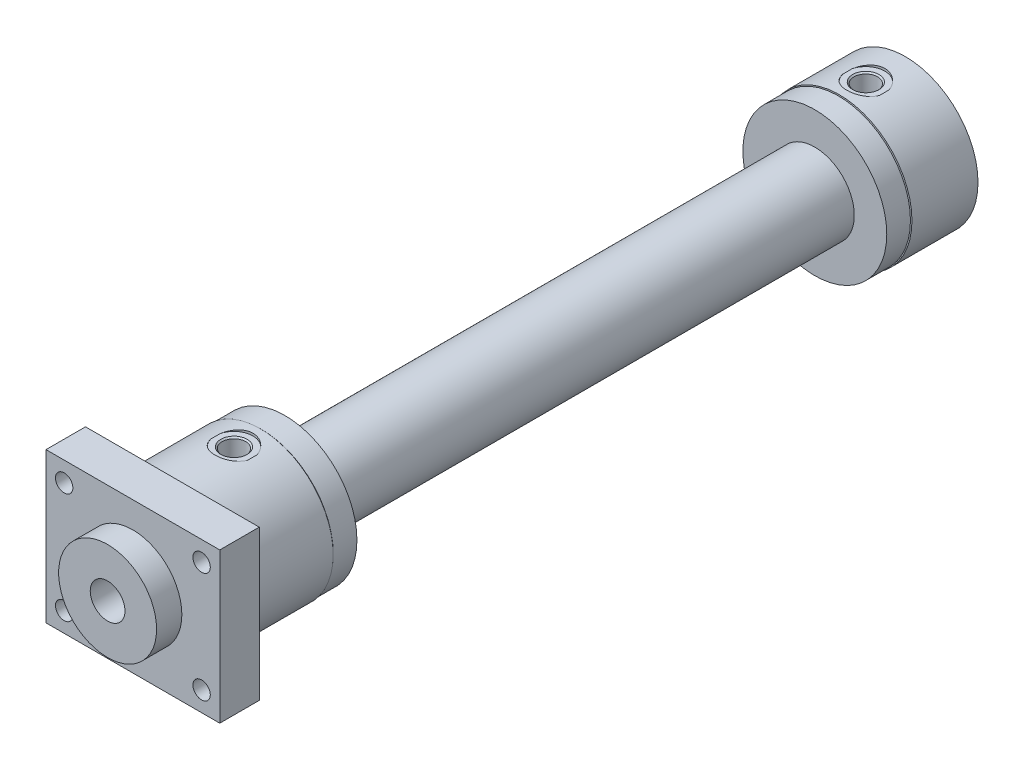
ISO-10303-21;
HEADER;
FILE_DESCRIPTION(('STEP AP214'),'2;1');
FILE_NAME('part.step','',(''),(''),'','','');
FILE_SCHEMA(('AUTOMOTIVE_DESIGN { 1 0 10303 214 1 1 1 1 }'));
ENDSEC;
DATA;
#1=APPLICATION_CONTEXT('core data for automotive mechanical design processes');
#2=APPLICATION_PROTOCOL_DEFINITION('international standard','automotive_design',2000,#1);
#3=PRODUCT_CONTEXT('',#1,'mechanical');
#4=PRODUCT('Part','Part','',(#3));
#5=PRODUCT_RELATED_PRODUCT_CATEGORY('part','',(#4));
#6=PRODUCT_DEFINITION_FORMATION('','',#4);
#7=PRODUCT_DEFINITION_CONTEXT('part definition',#1,'design');
#8=PRODUCT_DEFINITION('design','',#6,#7);
#9=PRODUCT_DEFINITION_SHAPE('','',#8);
#10=(LENGTH_UNIT() NAMED_UNIT(*) SI_UNIT(.MILLI.,.METRE.));
#11=(NAMED_UNIT(*) PLANE_ANGLE_UNIT() SI_UNIT($,.RADIAN.));
#12=(NAMED_UNIT(*) SI_UNIT($,.STERADIAN.) SOLID_ANGLE_UNIT());
#13=UNCERTAINTY_MEASURE_WITH_UNIT(LENGTH_MEASURE(1.E-05),#10,'distance_accuracy_value','');
#14=(GEOMETRIC_REPRESENTATION_CONTEXT(3) GLOBAL_UNCERTAINTY_ASSIGNED_CONTEXT((#13)) GLOBAL_UNIT_ASSIGNED_CONTEXT((#10,
#11,#12)) REPRESENTATION_CONTEXT('',''));
#15=CARTESIAN_POINT('',(0.,0.,0.));
#16=DIRECTION('',(0.,0.,1.));
#17=DIRECTION('',(1.,0.,0.));
#18=AXIS2_PLACEMENT_3D('',#15,#16,#17);
#19=CARTESIAN_POINT('',(0.,0.,-505.));
#20=DIRECTION('',(0.,0.,-1.));
#21=DIRECTION('',(1.,0.,0.));
#22=AXIS2_PLACEMENT_3D('',#19,#20,#21);
#23=PLANE('',#22);
#24=CARTESIAN_POINT('',(0.,0.,-505.));
#25=DIRECTION('',(0.,0.,-1.));
#26=DIRECTION('',(1.,0.,0.));
#27=AXIS2_PLACEMENT_3D('',#24,#25,#26);
#28=CIRCLE('',#27,46.);
#29=CARTESIAN_POINT('',(46.,0.,-505.));
#30=VERTEX_POINT('',#29);
#31=EDGE_CURVE('E193',#30,#30,#28,.T.);
#32=ORIENTED_EDGE('',*,*,#31,.T.);
#33=EDGE_LOOP('',(#32));
#34=FACE_BOUND('',#33,.T.);
#35=ADVANCED_FACE('F16',(#34),#23,.T.);
#36=CARTESIAN_POINT('',(0.,0.,-16.));
#37=DIRECTION('',(0.,0.,1.));
#38=DIRECTION('',(-1.,0.,0.));
#39=AXIS2_PLACEMENT_3D('',#36,#37,#38);
#40=PLANE('',#39);
#41=CARTESIAN_POINT('',(0.,0.,-16.));
#42=DIRECTION('',(0.,0.,-1.));
#43=DIRECTION('',(1.,0.,0.));
#44=AXIS2_PLACEMENT_3D('',#41,#42,#43);
#45=CIRCLE('',#44,31.);
#46=CARTESIAN_POINT('',(-31.,0.,-16.));
#47=VERTEX_POINT('',#46);
#48=EDGE_CURVE('E182',#47,#47,#45,.T.);
#49=ORIENTED_EDGE('',*,*,#48,.T.);
#50=EDGE_LOOP('',(#49));
#51=FACE_BOUND('',#50,.T.);
#52=CARTESIAN_POINT('',(43.5,35.,-16.));
#53=DIRECTION('',(0.,0.,-1.));
#54=DIRECTION('',(1.,0.,0.));
#55=AXIS2_PLACEMENT_3D('',#52,#53,#54);
#56=CIRCLE('',#55,5.5);
#57=CARTESIAN_POINT('',(38.,35.,-16.));
#58=VERTEX_POINT('',#57);
#59=EDGE_CURVE('E466',#58,#58,#56,.T.);
#60=ORIENTED_EDGE('',*,*,#59,.T.);
#61=EDGE_LOOP('',(#60));
#62=FACE_BOUND('',#61,.T.);
#63=CARTESIAN_POINT('',(43.5,-35.,-16.));
#64=DIRECTION('',(0.,0.,-1.));
#65=DIRECTION('',(1.,0.,0.));
#66=AXIS2_PLACEMENT_3D('',#63,#64,#65);
#67=CIRCLE('',#66,5.5);
#68=CARTESIAN_POINT('',(38.,-35.,-16.));
#69=VERTEX_POINT('',#68);
#70=EDGE_CURVE('E469',#69,#69,#67,.T.);
#71=ORIENTED_EDGE('',*,*,#70,.T.);
#72=EDGE_LOOP('',(#71));
#73=FACE_BOUND('',#72,.T.);
#74=CARTESIAN_POINT('',(-43.5,35.,-16.));
#75=DIRECTION('',(0.,0.,-1.));
#76=DIRECTION('',(1.,0.,0.));
#77=AXIS2_PLACEMENT_3D('',#74,#75,#76);
#78=CIRCLE('',#77,5.5);
#79=CARTESIAN_POINT('',(-49.,35.,-16.));
#80=VERTEX_POINT('',#79);
#81=EDGE_CURVE('E528',#80,#80,#78,.T.);
#82=ORIENTED_EDGE('',*,*,#81,.T.);
#83=EDGE_LOOP('',(#82));
#84=FACE_BOUND('',#83,.T.);
#85=CARTESIAN_POINT('',(-43.5,-35.,-16.));
#86=DIRECTION('',(0.,0.,-1.));
#87=DIRECTION('',(1.,0.,0.));
#88=AXIS2_PLACEMENT_3D('',#85,#86,#87);
#89=CIRCLE('',#88,5.5);
#90=CARTESIAN_POINT('',(-49.,-35.,-16.));
#91=VERTEX_POINT('',#90);
#92=EDGE_CURVE('E473',#91,#91,#89,.T.);
#93=ORIENTED_EDGE('',*,*,#92,.T.);
#94=EDGE_LOOP('',(#93));
#95=FACE_BOUND('',#94,.T.);
#96=DIRECTION('',(0.,1.,0.));
#97=VECTOR('',#96,1.);
#98=CARTESIAN_POINT('',(55.,0.,-16.));
#99=LINE('',#98,#97);
#100=CARTESIAN_POINT('',(55.,-47.5,-16.));
#101=VERTEX_POINT('',#100);
#102=CARTESIAN_POINT('',(55.,47.5,-16.));
#103=VERTEX_POINT('',#102);
#104=EDGE_CURVE('E455',#101,#103,#99,.T.);
#105=ORIENTED_EDGE('',*,*,#104,.T.);
#106=DIRECTION('',(-1.,0.,0.));
#107=VECTOR('',#106,1.);
#108=CARTESIAN_POINT('',(0.,47.5,-16.));
#109=LINE('',#108,#107);
#110=CARTESIAN_POINT('',(-55.,47.5,-16.));
#111=VERTEX_POINT('',#110);
#112=EDGE_CURVE('E199',#103,#111,#109,.T.);
#113=ORIENTED_EDGE('',*,*,#112,.T.);
#114=DIRECTION('',(0.,-1.,0.));
#115=VECTOR('',#114,1.);
#116=CARTESIAN_POINT('',(-55.,0.,-16.));
#117=LINE('',#116,#115);
#118=CARTESIAN_POINT('',(-55.,-47.5,-16.));
#119=VERTEX_POINT('',#118);
#120=EDGE_CURVE('E451',#111,#119,#117,.T.);
#121=ORIENTED_EDGE('',*,*,#120,.T.);
#122=DIRECTION('',(1.,0.,0.));
#123=VECTOR('',#122,1.);
#124=CARTESIAN_POINT('',(0.,-47.5,-16.));
#125=LINE('',#124,#123);
#126=EDGE_CURVE('E232',#119,#101,#125,.T.);
#127=ORIENTED_EDGE('',*,*,#126,.T.);
#128=EDGE_LOOP('',(#105,#113,#121,#127));
#129=FACE_BOUND('',#128,.T.);
#130=ADVANCED_FACE('F183',(#51,#62,#73,#84,#95,#129),#40,.T.);
#131=CARTESIAN_POINT('',(0.,0.,-260.5));
#132=DIRECTION('',(0.,0.,1.));
#133=DIRECTION('',(1.,0.,0.));
#134=AXIS2_PLACEMENT_3D('',#131,#132,#133);
#135=CYLINDRICAL_SURFACE('',#134,25.);
#136=CARTESIAN_POINT('',(0.,0.,-96.8));
#137=DIRECTION('',(0.,0.,-1.));
#138=DIRECTION('',(1.,0.,0.));
#139=AXIS2_PLACEMENT_3D('',#136,#137,#138);
#140=CIRCLE('',#139,25.);
#141=CARTESIAN_POINT('',(-25.,0.,-96.8));
#142=VERTEX_POINT('',#141);
#143=EDGE_CURVE('E11',#142,#142,#140,.T.);
#144=ORIENTED_EDGE('',*,*,#143,.T.);
#145=EDGE_LOOP('',(#144));
#146=FACE_BOUND('',#145,.T.);
#147=CARTESIAN_POINT('',(0.,0.,-97.3));
#148=DIRECTION('',(0.,0.,1.));
#149=DIRECTION('',(1.,0.,0.));
#150=AXIS2_PLACEMENT_3D('',#147,#148,#149);
#151=CIRCLE('',#150,25.);
#152=CARTESIAN_POINT('',(-25.,0.,-97.3));
#153=VERTEX_POINT('',#152);
#154=EDGE_CURVE('E442',#153,#153,#151,.T.);
#155=ORIENTED_EDGE('',*,*,#154,.T.);
#156=EDGE_LOOP('',(#155));
#157=FACE_BOUND('',#156,.T.);
#158=ADVANCED_FACE('F278',(#146,#157),#135,.T.);
#159=CARTESIAN_POINT('',(0.,0.,-56.4));
#160=DIRECTION('',(0.,0.,1.));
#161=DIRECTION('',(1.,0.,0.));
#162=AXIS2_PLACEMENT_3D('',#159,#160,#161);
#163=CYLINDRICAL_SURFACE('',#162,46.);
#164=CARTESIAN_POINT('',(0.,0.,-96.8));
#165=DIRECTION('',(0.,0.,-1.));
#166=DIRECTION('',(1.,0.,0.));
#167=AXIS2_PLACEMENT_3D('',#164,#165,#166);
#168=CIRCLE('',#167,46.);
#169=CARTESIAN_POINT('',(46.,0.,-96.8));
#170=VERTEX_POINT('',#169);
#171=EDGE_CURVE('E29',#170,#170,#168,.T.);
#172=ORIENTED_EDGE('',*,*,#171,.F.);
#173=EDGE_LOOP('',(#172));
#174=FACE_BOUND('',#173,.T.);
#175=CARTESIAN_POINT('',(0.,0.,-41.));
#176=DIRECTION('',(0.,0.,-1.));
#177=DIRECTION('',(1.,0.,0.));
#178=AXIS2_PLACEMENT_3D('',#175,#176,#177);
#179=CIRCLE('',#178,46.);
#180=CARTESIAN_POINT('',(-46.,0.,-41.));
#181=VERTEX_POINT('',#180);
#182=EDGE_CURVE('E465',#181,#181,#179,.T.);
#183=ORIENTED_EDGE('',*,*,#182,.T.);
#184=EDGE_LOOP('',(#183));
#185=FACE_BOUND('',#184,.T.);
#186=DIRECTION('',(0.,0.,-1.));
#187=VECTOR('',#186,1.);
#188=CARTESIAN_POINT('',(-11.651180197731,44.5,-80.));
#189=LINE('',#188,#187);
#190=CARTESIAN_POINT('',(-11.6511801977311,44.5,-77.1277186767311));
#191=VERTEX_POINT('',#190);
#192=CARTESIAN_POINT('',(-11.651180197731,44.5,-82.8722813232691));
#193=VERTEX_POINT('',#192);
#194=EDGE_CURVE('E244',#191,#193,#189,.T.);
#195=ORIENTED_EDGE('',*,*,#194,.T.);
#196=CARTESIAN_POINT('',(-11.6510746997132,44.5000276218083,-82.8722535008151));
#197=CARTESIAN_POINT('',(-11.6105546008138,44.5106350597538,-83.036476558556));
#198=CARTESIAN_POINT('',(-11.5666134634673,44.5220822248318,-83.1998023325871));
#199=CARTESIAN_POINT('',(-11.4720268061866,44.5465489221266,-83.5240522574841));
#200=CARTESIAN_POINT('',(-11.4213938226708,44.5595655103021,-83.6849802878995));
#201=CARTESIAN_POINT('',(-11.3134111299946,44.5871037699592,-84.0044365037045));
#202=CARTESIAN_POINT('',(-11.2560614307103,44.6016254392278,-84.1629646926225));
#203=CARTESIAN_POINT('',(-11.1346307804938,44.6320952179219,-84.4776206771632));
#204=CARTESIAN_POINT('',(-11.0705375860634,44.6480459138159,-84.6337434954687));
#205=CARTESIAN_POINT('',(-10.9361162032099,44.6811608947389,-84.9425518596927));
#206=CARTESIAN_POINT('',(-10.8658085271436,44.6983211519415,-85.0952467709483));
#207=CARTESIAN_POINT('',(-10.7189313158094,44.7337704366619,-85.3974093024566));
#208=CARTESIAN_POINT('',(-10.6423634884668,44.7520591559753,-85.5468777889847));
#209=CARTESIAN_POINT('',(-10.4829425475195,44.7896710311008,-85.842585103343));
#210=CARTESIAN_POINT('',(-10.4000801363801,44.8089957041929,-85.9888187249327));
#211=CARTESIAN_POINT('',(-10.2280727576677,44.8485712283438,-86.2780711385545));
#212=CARTESIAN_POINT('',(-10.1389081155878,44.8688249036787,-86.4210778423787));
#213=CARTESIAN_POINT('',(-9.95725504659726,44.9094811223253,-86.6992482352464));
#214=CARTESIAN_POINT('',(-9.86492683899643,44.9298640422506,-86.8345194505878));
#215=CARTESIAN_POINT('',(-9.67472980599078,44.9712027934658,-87.1012158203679));
#216=CARTESIAN_POINT('',(-9.57685582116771,44.9921591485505,-87.2326372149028));
#217=CARTESIAN_POINT('',(-9.37556335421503,45.0345358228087,-87.4916425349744));
#218=CARTESIAN_POINT('',(-9.27213110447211,45.0559572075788,-87.6192155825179));
#219=CARTESIAN_POINT('',(-9.05972677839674,45.0991479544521,-87.8705458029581));
#220=CARTESIAN_POINT('',(-8.95073309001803,45.1209184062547,-87.9942845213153));
#221=CARTESIAN_POINT('',(-8.73057185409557,45.1640275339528,-88.2341465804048));
#222=CARTESIAN_POINT('',(-8.61952695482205,45.1853633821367,-88.3503830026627));
#223=CARTESIAN_POINT('',(-8.39277369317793,45.2280295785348,-88.5782982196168));
#224=CARTESIAN_POINT('',(-8.2770637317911,45.2493599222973,-88.6899754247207));
#225=CARTESIAN_POINT('',(-8.04098999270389,45.2919075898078,-88.9087921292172));
#226=CARTESIAN_POINT('',(-7.9206177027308,45.3131246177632,-89.0159225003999));
#227=CARTESIAN_POINT('',(-7.67521935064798,45.3553366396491,-89.2256593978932));
#228=CARTESIAN_POINT('',(-7.55017854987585,45.3763306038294,-89.3282488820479));
#229=CARTESIAN_POINT('',(-7.29230148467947,45.4184974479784,-89.5313191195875));
#230=CARTESIAN_POINT('',(-7.15934409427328,45.4396573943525,-89.6316488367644));
#231=CARTESIAN_POINT('',(-6.88951871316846,45.4813492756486,-89.8265293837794));
#232=CARTESIAN_POINT('',(-6.75265788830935,45.5018822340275,-89.9210899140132));
#233=CARTESIAN_POINT('',(-6.47503817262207,45.5422172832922,-90.1044533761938));
#234=CARTESIAN_POINT('',(-6.33427949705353,45.5620194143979,-90.1932566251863));
#235=CARTESIAN_POINT('',(-6.04886497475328,45.6007895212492,-90.365108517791));
#236=CARTESIAN_POINT('',(-5.90420317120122,45.6197560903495,-90.448147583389));
#237=CARTESIAN_POINT('',(-5.6094083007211,45.6569482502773,-90.60936139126));
#238=CARTESIAN_POINT('',(-5.45922682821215,45.6751596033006,-90.687450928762));
#239=CARTESIAN_POINT('',(-5.15611192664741,45.7103676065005,-90.8370014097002));
#240=CARTESIAN_POINT('',(-5.00318982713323,45.7273682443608,-90.9084843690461));
#241=CARTESIAN_POINT('',(-4.69460734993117,45.7600775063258,-91.0448333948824));
#242=CARTESIAN_POINT('',(-4.53895218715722,45.7757883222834,-91.1097107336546));
#243=CARTESIAN_POINT('',(-4.22491241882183,45.8058401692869,-91.232842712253));
#244=CARTESIAN_POINT('',(-4.0665277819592,45.8201811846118,-91.2910972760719));
#245=CARTESIAN_POINT('',(-3.74754503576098,45.8473717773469,-91.4008957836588));
#246=CARTESIAN_POINT('',(-3.58694991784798,45.8602231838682,-91.4524479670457));
#247=CARTESIAN_POINT('',(-3.26430009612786,45.8843154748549,-91.548602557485));
#248=CARTESIAN_POINT('',(-3.10225419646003,45.8955628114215,-91.5932328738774));
#249=CARTESIAN_POINT('',(-2.7767186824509,45.9164063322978,-91.6755422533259));
#250=CARTESIAN_POINT('',(-2.61323350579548,45.9260064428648,-91.713237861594));
#251=CARTESIAN_POINT('',(-2.28483774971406,45.9435146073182,-91.7816745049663));
#252=CARTESIAN_POINT('',(-2.11992818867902,45.9514237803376,-91.8124201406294));
#253=CARTESIAN_POINT('',(-1.79265236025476,45.9653414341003,-91.8663920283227));
#254=CARTESIAN_POINT('',(-1.63031322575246,45.9713889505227,-91.8897729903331));
#255=CARTESIAN_POINT('',(-1.30523656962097,45.9817651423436,-91.9298456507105));
#256=CARTESIAN_POINT('',(-1.14250158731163,45.9860987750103,-91.9465566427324));
#257=CARTESIAN_POINT('',(-0.816651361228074,45.993038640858,-91.9732804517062));
#258=CARTESIAN_POINT('',(-0.653536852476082,45.9956470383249,-91.9833016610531));
#259=CARTESIAN_POINT('',(-0.326948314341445,45.9991280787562,-91.9966626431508));
#260=CARTESIAN_POINT('',(-0.163474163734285,46.0000000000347,-91.9999996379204));
#261=CARTESIAN_POINT('',(0.163462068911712,45.9999999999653,-92.0000003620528));
#262=CARTESIAN_POINT('',(0.326924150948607,45.9991282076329,-91.9966645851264));
#263=CARTESIAN_POINT('',(0.653496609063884,45.9956475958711,-91.9833052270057));
#264=CARTESIAN_POINT('',(0.816607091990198,45.9930394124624,-91.9732840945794));
#265=CARTESIAN_POINT('',(1.14245731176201,45.9860998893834,-91.9465601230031));
#266=CARTESIAN_POINT('',(1.30519628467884,45.9817663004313,-91.9298485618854));
#267=CARTESIAN_POINT('',(1.63028907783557,45.9713898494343,-91.8897749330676));
#268=CARTESIAN_POINT('',(1.79264031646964,45.9653419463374,-91.8663932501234));
#269=CARTESIAN_POINT('',(2.11991618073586,45.951424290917,-91.8124229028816));
#270=CARTESIAN_POINT('',(2.28481384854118,45.9435157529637,-91.7816805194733));
#271=CARTESIAN_POINT('',(2.61319377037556,45.9260086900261,-91.7132482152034));
#272=CARTESIAN_POINT('',(2.7766749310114,45.9164089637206,-91.6755533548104));
#273=CARTESIAN_POINT('',(3.10221042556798,45.8955657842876,-91.5932438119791));
#274=CARTESIAN_POINT('',(3.26426023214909,45.8843183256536,-91.5486122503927));
#275=CARTESIAN_POINT('',(3.5869260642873,45.8602250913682,-91.4524539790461));
#276=CARTESIAN_POINT('',(3.74753318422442,45.8473727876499,-91.4008990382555));
#277=CARTESIAN_POINT('',(4.0665164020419,45.8201821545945,-91.2911020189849));
#278=CARTESIAN_POINT('',(4.22488985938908,45.8058422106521,-91.2328526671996));
#279=CARTESIAN_POINT('',(4.53891475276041,45.7757920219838,-91.1097276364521));
#280=CARTESIAN_POINT('',(4.69456608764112,45.7600817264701,-91.0448517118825));
#281=CARTESIAN_POINT('',(5.00314852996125,45.72737277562,-90.9085025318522));
#282=CARTESIAN_POINT('',(5.1560742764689,45.7103718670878,-90.8370176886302));
#283=CARTESIAN_POINT('',(5.45920433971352,45.6751623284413,-90.6874608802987));
#284=CARTESIAN_POINT('',(5.60939717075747,45.6569496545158,-90.6093665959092));
#285=CARTESIAN_POINT('',(5.90419290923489,45.6197573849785,-90.4481540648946));
#286=CARTESIAN_POINT('',(6.04884472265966,45.6007921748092,-90.3651219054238));
#287=CARTESIAN_POINT('',(6.33424595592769,45.5620240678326,-90.1932792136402));
#288=CARTESIAN_POINT('',(6.47500115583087,45.5422225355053,-90.1044779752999));
#289=CARTESIAN_POINT('',(6.75262081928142,45.5018877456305,-89.9211143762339));
#290=CARTESIAN_POINT('',(6.88948487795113,45.4813544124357,-89.8265514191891));
#291=CARTESIAN_POINT('',(7.15932392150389,45.4396606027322,-89.6316622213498));
#292=CARTESIAN_POINT('',(7.2922915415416,45.4184990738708,-89.5313260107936));
#293=CARTESIAN_POINT('',(7.55016965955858,45.3763320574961,-89.3282567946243));
#294=CARTESIAN_POINT('',(7.67520189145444,45.3553395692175,-89.2256755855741));
#295=CARTESIAN_POINT('',(7.92058884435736,45.3131296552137,-89.0159497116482));
#296=CARTESIAN_POINT('',(8.04095809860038,45.2919132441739,-88.9088218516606));
#297=CARTESIAN_POINT('',(8.27703176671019,45.2493657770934,-88.6900050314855));
#298=CARTESIAN_POINT('',(8.39274447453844,45.2280350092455,-88.5783249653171));
#299=CARTESIAN_POINT('',(8.61950956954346,45.185366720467,-88.3503991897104));
#300=CARTESIAN_POINT('',(8.73056332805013,45.1640292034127,-88.2341548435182));
#301=CARTESIAN_POINT('',(8.95072544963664,45.1209199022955,-87.9942938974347));
#302=CARTESIAN_POINT('',(9.05971187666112,45.0991509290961,-87.8705648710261));
#303=CARTESIAN_POINT('',(9.27210654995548,45.0559622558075,-87.619247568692));
#304=CARTESIAN_POINT('',(9.37553616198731,45.0345414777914,-87.4916775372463));
#305=CARTESIAN_POINT('',(9.57682852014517,44.9921649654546,-87.2326721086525));
#306=CARTESIAN_POINT('',(9.67470477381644,44.9712081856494,-87.101247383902));
#307=CARTESIAN_POINT('',(9.86491202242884,44.9298673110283,-86.8345385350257));
#308=CARTESIAN_POINT('',(9.95724790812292,44.9094827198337,-86.6992579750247));
#309=CARTESIAN_POINT('',(10.1388984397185,44.8688270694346,-86.4210938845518));
#310=CARTESIAN_POINT('',(10.2280539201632,44.8485755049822,-86.2781035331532));
#311=CARTESIAN_POINT('',(10.4000491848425,44.8090028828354,-85.9888729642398));
#312=CARTESIAN_POINT('',(10.4829082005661,44.7896790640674,-85.8426445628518));
#313=CARTESIAN_POINT('',(10.6423289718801,44.752067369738,-85.5469371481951));
#314=CARTESIAN_POINT('',(10.7188995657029,44.7337780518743,-85.397463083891));
#315=CARTESIAN_POINT('',(10.8657896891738,44.6983257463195,-85.0952791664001));
#316=CARTESIAN_POINT('',(10.936107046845,44.6811631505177,-84.9425682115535));
#317=CARTESIAN_POINT('',(11.0705343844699,44.6480467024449,-84.6337555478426));
#318=CARTESIAN_POINT('',(11.1346250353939,44.6320966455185,-84.4776450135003));
#319=CARTESIAN_POINT('',(11.2560521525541,44.6016277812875,-84.1630053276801));
#320=CARTESIAN_POINT('',(11.3134005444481,44.5871064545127,-84.0044810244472));
#321=CARTESIAN_POINT('',(11.4213831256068,44.5595682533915,-83.6850247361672));
#322=CARTESIAN_POINT('',(11.4720169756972,44.5465514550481,-83.5240926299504));
#323=CARTESIAN_POINT('',(11.5666076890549,44.5220837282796,-83.1998265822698));
#324=CARTESIAN_POINT('',(11.6105516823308,44.5106358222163,-83.0364886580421));
#325=CARTESIAN_POINT('',(11.6510746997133,44.5000276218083,-82.8722535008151));
#326=B_SPLINE_CURVE_WITH_KNOTS('',3,(#196,#197,#198,#199,#200,#201,#202,#203,#204,#205,#206,
#207,#208,#209,#210,#211,#212,#213,#214,#215,#216,#217,#218,#219,#220,#221,#222,#223,#224,#225,
#226,#227,#228,#229,#230,#231,#232,#233,#234,#235,#236,#237,#238,#239,#240,#241,#242,#243,#244,
#245,#246,#247,#248,#249,#250,#251,#252,#253,#254,#255,#256,#257,#258,#259,#260,#261,#262,#263,
#264,#265,#266,#267,#268,#269,#270,#271,#272,#273,#274,#275,#276,#277,#278,#279,#280,#281,#282,
#283,#284,#285,#286,#287,#288,#289,#290,#291,#292,#293,#294,#295,#296,#297,#298,#299,#300,#301,
#302,#303,#304,#305,#306,#307,#308,#309,#310,#311,#312,#313,#314,#315,#316,#317,#318,#319,#320,
#321,#322,#323,#324,#325),.UNSPECIFIED.,.F.,.F.,(4,2,2,2,2,2,2,2,2,2,2,2,2,2,2,2,2,2,2,2,2,2,2,
2,2,2,2,2,2,2,2,2,2,2,2,2,2,2,2,2,2,2,2,2,2,2,2,2,2,2,2,2,2,2,2,2,2,2,2,2,2,2,2,2,4),(0.,
0.508403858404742,1.0158684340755,1.52333226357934,2.03173388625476,2.53851596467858,
3.04516023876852,3.55256798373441,4.06163641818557,4.55661996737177,5.05207182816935,
5.54881319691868,6.04765890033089,6.53402163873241,7.02055252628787,7.50801795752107,
7.99717993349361,8.50074520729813,9.00343901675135,9.50610511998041,10.0095874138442,
10.5201764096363,11.0289974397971,11.5369350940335,12.044878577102,12.5521915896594,
13.057402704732,13.5613923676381,14.0650474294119,14.5572807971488,15.0480798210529,
15.5382619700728,16.0286477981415,16.5189973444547,17.0091673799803,17.4999785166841,
17.9922481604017,18.4958663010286,18.9998436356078,19.5050670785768,20.0124170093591,
20.5203234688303,21.0282487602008,21.5370821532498,22.0477081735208,22.5511539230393,
23.0538078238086,23.5565138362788,24.0601156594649,24.5492417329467,25.0366951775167,
25.5232380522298,26.0096366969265,26.5084459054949,27.0051750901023,27.5006391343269,
27.9956591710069,28.5046710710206,29.0120599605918,29.5187230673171,30.025561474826,
30.5339260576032,31.0413774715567,31.5488545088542,32.0572958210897),.UNSPECIFIED.);
#327=CARTESIAN_POINT('',(11.651180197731,44.5,-82.8722813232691));
#328=VERTEX_POINT('',#327);
#329=EDGE_CURVE('E256',#193,#328,#326,.T.);
#330=ORIENTED_EDGE('',*,*,#329,.T.);
#331=DIRECTION('',(0.,0.,1.));
#332=VECTOR('',#331,1.);
#333=CARTESIAN_POINT('',(11.651180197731,44.5,-80.));
#334=LINE('',#333,#332);
#335=CARTESIAN_POINT('',(11.651180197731,44.5,-77.127718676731));
#336=VERTEX_POINT('',#335);
#337=EDGE_CURVE('E245',#328,#336,#334,.T.);
#338=ORIENTED_EDGE('',*,*,#337,.T.);
#339=CARTESIAN_POINT('',(11.6510746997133,44.5000276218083,-77.1277464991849));
#340=CARTESIAN_POINT('',(11.6105546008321,44.5106350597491,-76.9635234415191));
#341=CARTESIAN_POINT('',(11.5666134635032,44.5220822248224,-76.8001976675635));
#342=CARTESIAN_POINT('',(11.4720268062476,44.5465489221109,-76.4759477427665));
#343=CARTESIAN_POINT('',(11.4213938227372,44.5595655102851,-76.3150197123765));
#344=CARTESIAN_POINT('',(11.3134111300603,44.5871037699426,-75.9955634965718));
#345=CARTESIAN_POINT('',(11.2560614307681,44.6016254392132,-75.8370353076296));
#346=CARTESIAN_POINT('',(11.1346307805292,44.6320952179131,-75.5223793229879));
#347=CARTESIAN_POINT('',(11.0705375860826,44.6480459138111,-75.3662565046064));
#348=CARTESIAN_POINT('',(10.9361162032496,44.6811608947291,-75.0574481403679));
#349=CARTESIAN_POINT('',(10.8658085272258,44.6983211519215,-74.9047532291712));
#350=CARTESIAN_POINT('',(10.7189313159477,44.7337704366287,-74.6025906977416));
#351=CARTESIAN_POINT('',(10.642363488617,44.7520591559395,-74.4531222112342));
#352=CARTESIAN_POINT('',(10.4829425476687,44.7896710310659,-74.1574148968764));
#353=CARTESIAN_POINT('',(10.4000801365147,44.8089957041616,-74.0111812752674));
#354=CARTESIAN_POINT('',(10.2280727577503,44.8485712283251,-73.7219288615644));
#355=CARTESIAN_POINT('',(10.1389081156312,44.868824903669,-73.5789221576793));
#356=CARTESIAN_POINT('',(9.95725504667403,44.9094811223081,-73.3007517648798));
#357=CARTESIAN_POINT('',(9.8649268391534,44.929864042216,-73.1654805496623));
#358=CARTESIAN_POINT('',(9.67472980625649,44.9712027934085,-72.8987841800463));
#359=CARTESIAN_POINT('',(9.57685582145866,44.9921591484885,-72.767362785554));
#360=CARTESIAN_POINT('',(9.37556335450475,45.0345358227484,-72.508357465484));
#361=CARTESIAN_POINT('',(9.27213110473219,45.0559572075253,-72.3807844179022));
#362=CARTESIAN_POINT('',(9.05972677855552,45.0991479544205,-72.1294541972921));
#363=CARTESIAN_POINT('',(8.95073309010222,45.1209184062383,-72.0057154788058));
#364=CARTESIAN_POINT('',(8.7305718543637,45.1640275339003,-71.7658534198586));
#365=CARTESIAN_POINT('',(8.61952695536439,45.1853633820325,-71.6496169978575));
#366=CARTESIAN_POINT('',(8.39277369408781,45.2280295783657,-71.4217017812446));
#367=CARTESIAN_POINT('',(8.27706373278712,45.2493599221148,-71.3100245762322));
#368=CARTESIAN_POINT('',(8.04098999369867,45.2919075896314,-71.0912078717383));
#369=CARTESIAN_POINT('',(7.92061770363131,45.313124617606,-70.9840775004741));
#370=CARTESIAN_POINT('',(7.67521935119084,45.355336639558,-70.7743406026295));
#371=CARTESIAN_POINT('',(7.55017855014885,45.3763306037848,-70.6717511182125));
#372=CARTESIAN_POINT('',(7.29230148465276,45.4184974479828,-70.4686808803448));
#373=CARTESIAN_POINT('',(7.1593440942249,45.4396573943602,-70.3683511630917));
#374=CARTESIAN_POINT('',(6.88951871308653,45.481349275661,-70.1734706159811));
#375=CARTESIAN_POINT('',(6.75265788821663,45.5018822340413,-70.0789100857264));
#376=CARTESIAN_POINT('',(6.4750381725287,45.5422172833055,-69.8955466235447));
#377=CARTESIAN_POINT('',(6.33427949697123,45.5620194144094,-69.8067433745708));
#378=CARTESIAN_POINT('',(6.04886497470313,45.6007895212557,-69.6348914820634));
#379=CARTESIAN_POINT('',(5.90420317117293,45.6197560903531,-69.5518524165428));
#380=CARTESIAN_POINT('',(5.6094083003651,45.6569482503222,-69.3906386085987));
#381=CARTESIAN_POINT('',(5.45922682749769,45.6751596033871,-69.3125490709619));
#382=CARTESIAN_POINT('',(5.1561119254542,45.7103676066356,-69.1629985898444));
#383=CARTESIAN_POINT('',(5.00318982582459,45.7273682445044,-69.0915156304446));
#384=CARTESIAN_POINT('',(4.69460734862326,45.7600775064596,-68.9551666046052));
#385=CARTESIAN_POINT('',(4.53895218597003,45.7757883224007,-68.8902892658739));
#386=CARTESIAN_POINT('',(4.2249124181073,45.8058401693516,-68.7671572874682));
#387=CARTESIAN_POINT('',(4.06652778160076,45.8201811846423,-68.7089027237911));
#388=CARTESIAN_POINT('',(3.74754503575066,45.8473717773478,-68.5991042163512));
#389=CARTESIAN_POINT('',(3.58694991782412,45.8602231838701,-68.5475520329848));
#390=CARTESIAN_POINT('',(3.26430009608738,45.8843154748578,-68.4513974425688));
#391=CARTESIAN_POINT('',(3.1022541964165,45.8955628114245,-68.406767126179));
#392=CARTESIAN_POINT('',(2.77671868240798,45.9164063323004,-68.3244577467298));
#393=CARTESIAN_POINT('',(2.61323350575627,45.926006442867,-68.2867621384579));
#394=CARTESIAN_POINT('',(2.28483774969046,45.9435146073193,-68.2183254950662));
#395=CARTESIAN_POINT('',(2.11992818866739,45.9514237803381,-68.1875798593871));
#396=CARTESIAN_POINT('',(1.79265236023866,45.965341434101,-68.1336079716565));
#397=CARTESIAN_POINT('',(1.63031322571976,45.9713889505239,-68.1102270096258));
#398=CARTESIAN_POINT('',(1.3052365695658,45.9817651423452,-68.0701543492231));
#399=CARTESIAN_POINT('',(1.14250158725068,45.9860987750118,-68.0534433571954));
#400=CARTESIAN_POINT('',(0.8166513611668,45.9930386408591,-68.0267195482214));
#401=CARTESIAN_POINT('',(0.653536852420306,45.9956470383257,-68.0166983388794));
#402=CARTESIAN_POINT('',(0.326948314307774,45.9991280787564,-68.003337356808));
#403=CARTESIAN_POINT('',(0.16347416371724,46.0000000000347,-68.0000003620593));
#404=CARTESIAN_POINT('',(-0.16346206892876,45.9999999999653,-67.9999996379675));
#405=CARTESIAN_POINT('',(-0.326924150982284,45.9991282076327,-68.0033354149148));
#406=CARTESIAN_POINT('',(-0.653496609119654,45.9956475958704,-68.0166947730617));
#407=CARTESIAN_POINT('',(-0.816607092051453,45.9930394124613,-68.026715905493));
#408=CARTESIAN_POINT('',(-1.14245731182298,45.9860998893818,-68.0534398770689));
#409=CARTESIAN_POINT('',(-1.3051962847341,45.9817663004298,-68.0701514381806));
#410=CARTESIAN_POINT('',(-1.63028907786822,45.9713898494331,-68.1102250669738));
#411=CARTESIAN_POINT('',(-1.79264031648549,45.9653419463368,-68.1336067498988));
#412=CARTESIAN_POINT('',(-2.11991618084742,45.9514242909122,-68.1875770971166));
#413=CARTESIAN_POINT('',(-2.28481384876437,45.943515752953,-68.2183194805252));
#414=CARTESIAN_POINT('',(-2.61319377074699,45.9260086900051,-68.2867517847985));
#415=CARTESIAN_POINT('',(-2.77667493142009,45.916408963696,-68.3244466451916));
#416=CARTESIAN_POINT('',(-3.10221042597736,45.8955657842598,-68.4067561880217));
#417=CARTESIAN_POINT('',(-3.26426023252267,45.8843183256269,-68.451387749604));
#418=CARTESIAN_POINT('',(-3.58692606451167,45.8602250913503,-68.5475460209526));
#419=CARTESIAN_POINT('',(-3.74753318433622,45.8473727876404,-68.5991009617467));
#420=CARTESIAN_POINT('',(-4.066516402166,45.8201821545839,-68.7088979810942));
#421=CARTESIAN_POINT('',(-4.22488985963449,45.8058422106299,-68.7671473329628));
#422=CARTESIAN_POINT('',(-4.5389147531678,45.7757920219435,-68.8902723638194));
#423=CARTESIAN_POINT('',(-4.69456608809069,45.7600817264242,-68.9551482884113));
#424=CARTESIAN_POINT('',(-5.00314853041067,45.7273727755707,-69.0914974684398));
#425=CARTESIAN_POINT('',(-5.15607427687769,45.7103718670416,-69.1629823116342));
#426=CARTESIAN_POINT('',(-5.45920433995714,45.6751623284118,-69.3125391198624));
#427=CARTESIAN_POINT('',(-5.60939717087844,45.6569496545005,-69.3906334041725));
#428=CARTESIAN_POINT('',(-5.9041929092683,45.6197573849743,-69.5518459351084));
#429=CARTESIAN_POINT('',(-6.04884472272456,45.6007921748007,-69.6348780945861));
#430=CARTESIAN_POINT('',(-6.33424595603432,45.5620240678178,-69.8067207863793));
#431=CARTESIAN_POINT('',(-6.47500115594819,45.5422225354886,-69.8955220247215));
#432=CARTESIAN_POINT('',(-6.75262081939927,45.501887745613,-70.0788856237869));
#433=CARTESIAN_POINT('',(-6.88948487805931,45.4813544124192,-70.1734485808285));
#434=CARTESIAN_POINT('',(-7.1593239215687,45.4396606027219,-70.3683377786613));
#435=CARTESIAN_POINT('',(-7.29229154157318,45.4184990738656,-70.4686739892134));
#436=CARTESIAN_POINT('',(-7.55016965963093,45.3763320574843,-70.6717432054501));
#437=CARTESIAN_POINT('',(-7.67520189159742,45.3553395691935,-70.7743244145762));
#438=CARTESIAN_POINT('',(-7.92058884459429,45.3131296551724,-70.9840502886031));
#439=CARTESIAN_POINT('',(-8.04095809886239,45.2919132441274,-71.0911781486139));
#440=CARTESIAN_POINT('',(-8.27703176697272,45.2493657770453,-71.309994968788));
#441=CARTESIAN_POINT('',(-8.39274447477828,45.2280350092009,-71.4216750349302));
#442=CARTESIAN_POINT('',(-8.61950956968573,45.1853667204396,-71.6496008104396));
#443=CARTESIAN_POINT('',(-8.73056332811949,45.1640292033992,-71.7658451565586));
#444=CARTESIAN_POINT('',(-8.95072544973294,45.1209199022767,-72.005706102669));
#445=CARTESIAN_POINT('',(-9.05971187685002,45.0991509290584,-72.1294351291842));
#446=CARTESIAN_POINT('',(-9.27210655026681,45.0559622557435,-72.3807524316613));
#447=CARTESIAN_POINT('',(-9.37553616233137,45.0345414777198,-72.5083224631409));
#448=CARTESIAN_POINT('',(-9.57682852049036,44.9921649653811,-72.7673278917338));
#449=CARTESIAN_POINT('',(-9.67470477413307,44.9712081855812,-72.8987526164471));
#450=CARTESIAN_POINT('',(-9.86491202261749,44.9298673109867,-73.165461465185));
#451=CARTESIAN_POINT('',(-9.95724790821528,44.909482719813,-73.3007420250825));
#452=CARTESIAN_POINT('',(-10.1388984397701,44.8688270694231,-73.5789061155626));
#453=CARTESIAN_POINT('',(-10.2280539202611,44.84857550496,-73.721896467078));
#454=CARTESIAN_POINT('',(-10.4000491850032,44.8090028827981,-74.0111270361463));
#455=CARTESIAN_POINT('',(-10.482908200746,44.7896790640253,-74.1573554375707));
#456=CARTESIAN_POINT('',(-10.642328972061,44.752067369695,-74.4530628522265));
#457=CARTESIAN_POINT('',(-10.7188995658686,44.7337780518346,-74.6025369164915));
#458=CARTESIAN_POINT('',(-10.8657896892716,44.6983257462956,-74.9047208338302));
#459=CARTESIAN_POINT('',(-10.9361070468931,44.6811631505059,-75.057431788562));
#460=CARTESIAN_POINT('',(-11.0705343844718,44.6480467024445,-75.3662444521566));
#461=CARTESIAN_POINT('',(-11.1346250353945,44.6320966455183,-75.5223549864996));
#462=CARTESIAN_POINT('',(-11.2560521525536,44.6016277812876,-75.8369946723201));
#463=CARTESIAN_POINT('',(-11.313400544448,44.5871064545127,-75.9955189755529));
#464=CARTESIAN_POINT('',(-11.421383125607,44.5595682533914,-76.3149752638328));
#465=CARTESIAN_POINT('',(-11.4720169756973,44.5465514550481,-76.4759073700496));
#466=CARTESIAN_POINT('',(-11.5666076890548,44.5220837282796,-76.8001734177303));
#467=CARTESIAN_POINT('',(-11.6105516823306,44.5106358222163,-76.9635113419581));
#468=CARTESIAN_POINT('',(-11.6510746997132,44.5000276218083,-77.127746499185));
#469=B_SPLINE_CURVE_WITH_KNOTS('',3,(#339,#340,#341,#342,#343,#344,#345,#346,#347,#348,#349,
#350,#351,#352,#353,#354,#355,#356,#357,#358,#359,#360,#361,#362,#363,#364,#365,#366,#367,#368,
#369,#370,#371,#372,#373,#374,#375,#376,#377,#378,#379,#380,#381,#382,#383,#384,#385,#386,#387,
#388,#389,#390,#391,#392,#393,#394,#395,#396,#397,#398,#399,#400,#401,#402,#403,#404,#405,#406,
#407,#408,#409,#410,#411,#412,#413,#414,#415,#416,#417,#418,#419,#420,#421,#422,#423,#424,#425,
#426,#427,#428,#429,#430,#431,#432,#433,#434,#435,#436,#437,#438,#439,#440,#441,#442,#443,#444,
#445,#446,#447,#448,#449,#450,#451,#452,#453,#454,#455,#456,#457,#458,#459,#460,#461,#462,#463,
#464,#465,#466,#467,#468),.UNSPECIFIED.,.F.,.F.,(4,2,2,2,2,2,2,2,2,2,2,2,2,2,2,2,2,2,2,2,2,2,2,
2,2,2,2,2,2,2,2,2,2,2,2,2,2,2,2,2,2,2,2,2,2,2,2,2,2,2,2,2,2,2,2,2,2,2,2,2,2,2,2,2,4),(0.,
0.508403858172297,1.01586843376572,1.52333226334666,2.03173388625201,2.53851596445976,
3.04516023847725,3.55256798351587,4.06163641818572,4.55661996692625,5.05207182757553,
5.54881319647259,6.04765890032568,6.53402163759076,7.02055252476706,7.50801795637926,
7.99717993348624,8.50074520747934,9.00343901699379,9.50610512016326,10.0095874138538,
10.5201764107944,11.0289974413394,11.536935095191,12.0448785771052,12.5521915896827,
13.0574027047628,13.5613923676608,14.0650474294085,14.557280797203,15.0480798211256,
15.5382619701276,16.0286477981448,16.5189973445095,17.0091673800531,17.4999785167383,
17.9922481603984,18.4958663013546,18.9998436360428,19.5050670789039,20.0124170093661,
20.5203234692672,21.0282487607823,21.5370821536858,22.0477081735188,22.55115392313,
23.0538078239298,23.55651383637,24.0601156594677,24.5492417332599,25.0366951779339,
25.5232380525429,26.0096366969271,26.5084459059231,27.0051750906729,27.5006391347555,
27.9956591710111,28.5046710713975,29.0120599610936,29.5187230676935,30.0255614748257,
30.5339260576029,31.0413774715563,31.5488545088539,32.0572958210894),.UNSPECIFIED.);
#470=EDGE_CURVE('E301',#336,#191,#469,.T.);
#471=ORIENTED_EDGE('',*,*,#470,.T.);
#472=EDGE_LOOP('',(#195,#330,#338,#471));
#473=FACE_BOUND('',#472,.T.);
#474=ADVANCED_FACE('F267',(#174,#185,#473),#163,.T.);
#475=CARTESIAN_POINT('',(0.,0.,-96.8));
#476=DIRECTION('',(0.,0.,-1.));
#477=DIRECTION('',(1.,0.,0.));
#478=AXIS2_PLACEMENT_3D('',#475,#476,#477);
#479=PLANE('',#478);
#480=ORIENTED_EDGE('',*,*,#143,.F.);
#481=EDGE_LOOP('',(#480));
#482=FACE_BOUND('',#481,.T.);
#483=ORIENTED_EDGE('',*,*,#171,.T.);
#484=EDGE_LOOP('',(#483));
#485=FACE_BOUND('',#484,.T.);
#486=ADVANCED_FACE('F277',(#482,#485),#479,.T.);
#487=CARTESIAN_POINT('',(0.,0.,-484.1));
#488=DIRECTION('',(0.,0.,1.));
#489=DIRECTION('',(1.,0.,0.));
#490=AXIS2_PLACEMENT_3D('',#487,#488,#489);
#491=CYLINDRICAL_SURFACE('',#490,46.);
#492=ORIENTED_EDGE('',*,*,#31,.F.);
#493=EDGE_LOOP('',(#492));
#494=FACE_BOUND('',#493,.T.);
#495=CARTESIAN_POINT('',(0.,0.,-463.2));
#496=DIRECTION('',(0.,0.,1.));
#497=DIRECTION('',(1.,0.,0.));
#498=AXIS2_PLACEMENT_3D('',#495,#496,#497);
#499=CIRCLE('',#498,46.);
#500=CARTESIAN_POINT('',(46.,0.,-463.2));
#501=VERTEX_POINT('',#500);
#502=EDGE_CURVE('E187',#501,#501,#499,.T.);
#503=ORIENTED_EDGE('',*,*,#502,.F.);
#504=EDGE_LOOP('',(#503));
#505=FACE_BOUND('',#504,.T.);
#506=DIRECTION('',(0.,0.,-1.));
#507=VECTOR('',#506,1.);
#508=CARTESIAN_POINT('',(-11.651180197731,44.5,-480.));
#509=LINE('',#508,#507);
#510=CARTESIAN_POINT('',(-11.6511801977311,44.5,-477.127718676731));
#511=VERTEX_POINT('',#510);
#512=CARTESIAN_POINT('',(-11.651180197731,44.5,-482.872281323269));
#513=VERTEX_POINT('',#512);
#514=EDGE_CURVE('E421',#511,#513,#509,.T.);
#515=ORIENTED_EDGE('',*,*,#514,.T.);
#516=CARTESIAN_POINT('',(-11.6510746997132,44.5000276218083,-482.872253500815));
#517=CARTESIAN_POINT('',(-11.6105546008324,44.510635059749,-483.036476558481));
#518=CARTESIAN_POINT('',(-11.5666134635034,44.5220822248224,-483.199802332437));
#519=CARTESIAN_POINT('',(-11.4720268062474,44.546548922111,-483.524052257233));
#520=CARTESIAN_POINT('',(-11.4213938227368,44.5595655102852,-483.684980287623));
#521=CARTESIAN_POINT('',(-11.3134111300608,44.5871037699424,-484.004436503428));
#522=CARTESIAN_POINT('',(-11.2560614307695,44.6016254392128,-484.162964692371));
#523=CARTESIAN_POINT('',(-11.1346307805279,44.6320952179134,-484.477620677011));
#524=CARTESIAN_POINT('',(-11.0705375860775,44.6480459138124,-484.633743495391));
#525=CARTESIAN_POINT('',(-10.9361162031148,44.6811608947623,-484.942551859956));
#526=CARTESIAN_POINT('',(-10.8658085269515,44.6983211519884,-485.095246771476));
#527=CARTESIAN_POINT('',(-10.7189313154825,44.7337704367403,-485.397409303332));
#528=CARTESIAN_POINT('',(-10.642363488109,44.7520591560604,-485.54687778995));
#529=CARTESIAN_POINT('',(-10.4829425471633,44.789671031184,-485.84258510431));
#530=CARTESIAN_POINT('',(-10.4000801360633,44.8089957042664,-485.988818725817));
#531=CARTESIAN_POINT('',(-10.2280727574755,44.8485712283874,-486.278071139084));
#532=CARTESIAN_POINT('',(-10.1389081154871,44.8688249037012,-486.421077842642));
#533=CARTESIAN_POINT('',(-9.95725504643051,44.9094811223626,-486.699248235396));
#534=CARTESIAN_POINT('',(-9.86492683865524,44.9298640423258,-486.834519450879));
#535=CARTESIAN_POINT('',(-9.67472980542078,44.9712027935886,-487.101215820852));
#536=CARTESIAN_POINT('',(-9.57685582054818,44.9921591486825,-487.23263721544));
#537=CARTESIAN_POINT('',(-9.37556335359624,45.0345358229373,-487.491642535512));
#538=CARTESIAN_POINT('',(-9.27213110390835,45.0559572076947,-487.619215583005));
#539=CARTESIAN_POINT('',(-9.05972677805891,45.0991479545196,-487.870545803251));
#540=CARTESIAN_POINT('',(-8.95073308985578,45.1209184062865,-487.994284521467));
#541=CARTESIAN_POINT('',(-8.73057185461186,45.1640275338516,-488.234146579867));
#542=CARTESIAN_POINT('',(-8.61952695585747,45.1853633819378,-488.350383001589));
#543=CARTESIAN_POINT('',(-8.3927736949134,45.2280295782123,-488.578298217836));
#544=CARTESIAN_POINT('',(-8.27706373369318,45.2493599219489,-488.689975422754));
#545=CARTESIAN_POINT('',(-8.04098999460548,45.2919075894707,-488.908792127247));
#546=CARTESIAN_POINT('',(-7.92061770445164,45.3131246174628,-489.015922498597));
#547=CARTESIAN_POINT('',(-7.67521935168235,45.3553366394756,-489.22565939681));
#548=CARTESIAN_POINT('',(-7.55017855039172,45.3763306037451,-489.328248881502));
#549=CARTESIAN_POINT('',(-7.2923014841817,45.4184974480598,-489.531319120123));
#550=CARTESIAN_POINT('',(-7.15934409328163,45.4396573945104,-489.631648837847));
#551=CARTESIAN_POINT('',(-6.88951871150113,45.4813492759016,-489.826529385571));
#552=CARTESIAN_POINT('',(-6.75265788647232,45.5018822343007,-489.921089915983));
#553=CARTESIAN_POINT('',(-6.47503817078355,45.5422172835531,-490.104453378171));
#554=CARTESIAN_POINT('',(-6.33427949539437,45.5620194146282,-490.193256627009));
#555=CARTESIAN_POINT('',(-6.04886497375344,45.60078952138,-490.365108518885));
#556=CARTESIAN_POINT('',(-5.90420317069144,45.6197560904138,-490.448147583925));
#557=CARTESIAN_POINT('',(-5.60940829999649,45.6569482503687,-490.609361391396));
#558=CARTESIAN_POINT('',(-5.45922682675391,45.6751596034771,-490.687450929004));
#559=CARTESIAN_POINT('',(-5.1561119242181,45.7103676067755,-490.837001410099));
#560=CARTESIAN_POINT('',(-5.00318982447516,45.7273682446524,-490.908484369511));
#561=CARTESIAN_POINT('',(-4.69460734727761,45.7600775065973,-491.044833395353));
#562=CARTESIAN_POINT('',(-4.53895218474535,45.7757883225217,-491.109710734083));
#563=CARTESIAN_POINT('',(-4.2249124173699,45.8058401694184,-491.232842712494));
#564=CARTESIAN_POINT('',(-4.06652778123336,45.8201811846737,-491.291097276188));
#565=CARTESIAN_POINT('',(-3.74754503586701,45.8473717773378,-491.400895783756));
#566=CARTESIAN_POINT('',(-3.58694991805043,45.860223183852,-491.452447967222));
#567=CARTESIAN_POINT('',(-3.26430009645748,45.8843154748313,-491.548602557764));
#568=CARTESIAN_POINT('',(-3.10225419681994,45.8955628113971,-491.593232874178));
#569=CARTESIAN_POINT('',(-2.77671868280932,45.9164063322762,-491.675542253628));
#570=CARTESIAN_POINT('',(-2.61323350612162,45.9260064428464,-491.713237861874));
#571=CARTESIAN_POINT('',(-2.28483774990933,45.9435146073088,-491.78167450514));
#572=CARTESIAN_POINT('',(-2.1199281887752,45.9514237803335,-491.812420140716));
#573=CARTESIAN_POINT('',(-1.79265236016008,45.9653414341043,-491.866392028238));
#574=CARTESIAN_POINT('',(-1.63031322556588,45.9713889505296,-491.889772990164));
#575=CARTESIAN_POINT('',(-1.30523656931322,45.9817651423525,-491.929845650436));
#576=CARTESIAN_POINT('',(-1.14250158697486,45.9860987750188,-491.946556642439));
#577=CARTESIAN_POINT('',(-0.816651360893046,45.9930386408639,-491.973280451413));
#578=CARTESIAN_POINT('',(-0.653536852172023,45.9956470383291,-491.983301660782));
#579=CARTESIAN_POINT('',(-0.32694831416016,45.9991280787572,-491.996662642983));
#580=CARTESIAN_POINT('',(-0.163474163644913,46.0000000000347,-491.999999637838));
#581=CARTESIAN_POINT('',(0.163462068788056,45.9999999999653,-492.000000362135));
#582=CARTESIAN_POINT('',(0.326924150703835,45.9991282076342,-491.996664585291));
#583=CARTESIAN_POINT('',(0.653496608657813,45.9956475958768,-491.983305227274));
#584=CARTESIAN_POINT('',(0.8166070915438,45.9930394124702,-491.973284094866));
#585=CARTESIAN_POINT('',(1.1424573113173,45.9860998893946,-491.946560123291));
#586=CARTESIAN_POINT('',(1.30519628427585,45.9817663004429,-491.929848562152));
#587=CARTESIAN_POINT('',(1.63028907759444,45.9713898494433,-491.889774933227));
#588=CARTESIAN_POINT('',(1.79264031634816,45.9653419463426,-491.866393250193));
#589=CARTESIAN_POINT('',(2.11991618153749,45.9514242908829,-491.812422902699));
#590=CARTESIAN_POINT('',(2.28481385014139,45.943515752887,-491.781680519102));
#591=CARTESIAN_POINT('',(2.613193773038,45.9260086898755,-491.713248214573));
#592=CARTESIAN_POINT('',(2.77667493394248,45.9164089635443,-491.675553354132));
#593=CARTESIAN_POINT('',(3.10221042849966,45.8955657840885,-491.593243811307));
#594=CARTESIAN_POINT('',(3.2642602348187,45.8843183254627,-491.548612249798));
#595=CARTESIAN_POINT('',(3.58692606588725,45.8602250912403,-491.452453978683));
#596=CARTESIAN_POINT('',(3.74753318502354,45.8473727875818,-491.400899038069));
#597=CARTESIAN_POINT('',(4.06651640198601,45.8201821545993,-491.291102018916));
#598=CARTESIAN_POINT('',(4.22488985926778,45.8058422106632,-491.232852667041));
#599=CARTESIAN_POINT('',(4.53891475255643,45.7757920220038,-491.109727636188));
#600=CARTESIAN_POINT('',(4.69456608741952,45.7600817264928,-491.044851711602));
#601=CARTESIAN_POINT('',(5.00314852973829,45.7273727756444,-490.908502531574));
#602=CARTESIAN_POINT('',(5.15607427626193,45.7103718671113,-490.83701768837));
#603=CARTESIAN_POINT('',(5.4592043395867,45.6751623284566,-490.68746088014));
#604=CARTESIAN_POINT('',(5.60939717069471,45.6569496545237,-490.609366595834));
#605=CARTESIAN_POINT('',(5.90419290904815,45.6197573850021,-490.448154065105));
#606=CARTESIAN_POINT('',(6.04884472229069,45.6007921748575,-490.365121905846));
#607=CARTESIAN_POINT('',(6.33424595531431,45.5620240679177,-490.193279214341));
#608=CARTESIAN_POINT('',(6.4750011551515,45.5422225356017,-490.104477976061));
#609=CARTESIAN_POINT('',(6.75262081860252,45.5018877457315,-489.921114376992));
#610=CARTESIAN_POINT('',(6.8894848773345,45.4813544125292,-489.826551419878));
#611=CARTESIAN_POINT('',(7.15932392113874,45.4396606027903,-489.631662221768));
#612=CARTESIAN_POINT('',(7.29229154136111,45.4184990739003,-489.531326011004));
#613=CARTESIAN_POINT('',(7.55016965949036,45.3763320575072,-489.328256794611));
#614=CARTESIAN_POINT('',(7.67520189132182,45.3553395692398,-489.225675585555));
#615=CARTESIAN_POINT('',(7.92058884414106,45.3131296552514,-489.015949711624));
#616=CARTESIAN_POINT('',(8.04095809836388,45.2919132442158,-488.908821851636));
#617=CARTESIAN_POINT('',(8.27703176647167,45.2493657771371,-488.69000503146));
#618=CARTESIAN_POINT('',(8.39274447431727,45.2280350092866,-488.57832496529));
#619=CARTESIAN_POINT('',(8.61950956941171,45.1853667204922,-488.350399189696));
#620=CARTESIAN_POINT('',(8.73056332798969,45.1640292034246,-488.234154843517));
#621=CARTESIAN_POINT('',(8.95072544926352,45.1209199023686,-487.99429389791));
#622=CARTESIAN_POINT('',(9.05971187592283,45.0991509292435,-487.870564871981));
#623=CARTESIAN_POINT('',(9.27210654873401,45.0559622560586,-487.61924757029));
#624=CARTESIAN_POINT('',(9.37553616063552,45.0345414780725,-487.491677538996));
#625=CARTESIAN_POINT('',(9.57682851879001,44.9921649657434,-487.232672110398));
#626=CARTESIAN_POINT('',(9.67470477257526,44.9712081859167,-487.101247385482));
#627=CARTESIAN_POINT('',(9.86491202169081,44.9298673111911,-486.834538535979));
#628=CARTESIAN_POINT('',(9.95724790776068,44.9094827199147,-486.699257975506));
#629=CARTESIAN_POINT('',(10.1388984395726,44.8688270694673,-486.42109388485));
#630=CARTESIAN_POINT('',(10.22805391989,44.8485755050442,-486.278103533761));
#631=CARTESIAN_POINT('',(10.4000491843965,44.8090028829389,-485.988872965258));
#632=CARTESIAN_POINT('',(10.4829082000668,44.7896790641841,-485.842644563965));
#633=CARTESIAN_POINT('',(10.6423289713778,44.7520673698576,-485.546937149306));
#634=CARTESIAN_POINT('',(10.7188995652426,44.7337780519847,-485.397463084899));
#635=CARTESIAN_POINT('',(10.8657896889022,44.6983257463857,-485.095279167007));
#636=CARTESIAN_POINT('',(10.9361070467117,44.6811631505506,-484.942568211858));
#637=CARTESIAN_POINT('',(11.0705343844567,44.6480467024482,-484.633755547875));
#638=CARTESIAN_POINT('',(11.1346250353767,44.6320966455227,-484.477645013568));
#639=CARTESIAN_POINT('',(11.2560521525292,44.6016277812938,-484.163005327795));
#640=CARTESIAN_POINT('',(11.3134005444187,44.5871064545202,-484.004481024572));
#641=CARTESIAN_POINT('',(11.4213831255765,44.5595682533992,-483.685024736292));
#642=CARTESIAN_POINT('',(11.4720169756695,44.5465514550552,-483.524092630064));
#643=CARTESIAN_POINT('',(11.5666076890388,44.5220837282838,-483.199826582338));
#644=CARTESIAN_POINT('',(11.6105516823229,44.5106358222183,-483.036488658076));
#645=CARTESIAN_POINT('',(11.6510746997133,44.5000276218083,-482.872253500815));
#646=B_SPLINE_CURVE_WITH_KNOTS('',3,(#516,#517,#518,#519,#520,#521,#522,#523,#524,#525,#526,
#527,#528,#529,#530,#531,#532,#533,#534,#535,#536,#537,#538,#539,#540,#541,#542,#543,#544,#545,
#546,#547,#548,#549,#550,#551,#552,#553,#554,#555,#556,#557,#558,#559,#560,#561,#562,#563,#564,
#565,#566,#567,#568,#569,#570,#571,#572,#573,#574,#575,#576,#577,#578,#579,#580,#581,#582,#583,
#584,#585,#586,#587,#588,#589,#590,#591,#592,#593,#594,#595,#596,#597,#598,#599,#600,#601,#602,
#603,#604,#605,#606,#607,#608,#609,#610,#611,#612,#613,#614,#615,#616,#617,#618,#619,#620,#621,
#622,#623,#624,#625,#626,#627,#628,#629,#630,#631,#632,#633,#634,#635,#636,#637,#638,#639,#640,
#641,#642,#643,#644,#645),.UNSPECIFIED.,.F.,.F.,(4,2,2,2,2,2,2,2,2,2,2,2,2,2,2,2,2,2,2,2,2,2,2,
2,2,2,2,2,2,2,2,2,2,2,2,2,2,2,2,2,2,2,2,2,2,2,2,2,2,2,2,2,2,2,2,2,2,2,2,2,2,2,2,2,4),(0.,
0.508403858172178,1.01586843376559,1.52333226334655,2.03173388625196,2.53851596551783,
3.04516023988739,3.55256798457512,4.06163641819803,4.55661996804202,5.05207182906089,
5.54881319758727,6.04765890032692,6.53402163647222,7.02055252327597,7.5080179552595,
7.99717993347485,8.50074520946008,9.00343901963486,9.50610512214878,10.0095874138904,
10.5201764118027,11.0289974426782,11.5369350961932,12.0448785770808,12.5521915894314,
13.0574027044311,13.5613923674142,14.0650474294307,14.5572807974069,15.0480798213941,
15.5382619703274,16.0286477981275,16.5189973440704,17.0091673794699,17.4999785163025,
17.9922481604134,18.4958663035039,18.999843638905,19.5050670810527,20.0124170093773,
20.520323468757,21.0282487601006,21.5370821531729,22.0477081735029,22.5511539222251,
23.0538078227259,23.5565138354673,24.0601156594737,24.5492417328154,25.0366951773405,
25.5232380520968,26.0096366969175,26.5084459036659,27.0051750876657,27.500639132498,
27.9956591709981,28.504671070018,29.0120599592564,29.5187230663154,30.0255614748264,
30.5339260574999,31.0413774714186,31.5488545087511,32.0572958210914),.UNSPECIFIED.);
#647=CARTESIAN_POINT('',(11.651180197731,44.5,-482.872281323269));
#648=VERTEX_POINT('',#647);
#649=EDGE_CURVE('E215',#513,#648,#646,.T.);
#650=ORIENTED_EDGE('',*,*,#649,.T.);
#651=DIRECTION('',(0.,0.,1.));
#652=VECTOR('',#651,1.);
#653=CARTESIAN_POINT('',(11.651180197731,44.5,-480.));
#654=LINE('',#653,#652);
#655=CARTESIAN_POINT('',(11.651180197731,44.5,-477.127718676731));
#656=VERTEX_POINT('',#655);
#657=EDGE_CURVE('E426',#648,#656,#654,.T.);
#658=ORIENTED_EDGE('',*,*,#657,.T.);
#659=CARTESIAN_POINT('',(11.6510746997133,44.5000276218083,-477.127746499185));
#660=CARTESIAN_POINT('',(11.6105546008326,44.5106350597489,-476.963523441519));
#661=CARTESIAN_POINT('',(11.5666134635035,44.5220822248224,-476.800197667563));
#662=CARTESIAN_POINT('',(11.4720268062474,44.546548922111,-476.475947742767));
#663=CARTESIAN_POINT('',(11.4213938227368,44.5595655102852,-476.315019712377));
#664=CARTESIAN_POINT('',(11.3134111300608,44.5871037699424,-475.995563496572));
#665=CARTESIAN_POINT('',(11.2560614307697,44.6016254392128,-475.837035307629));
#666=CARTESIAN_POINT('',(11.1346307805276,44.6320952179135,-475.522379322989));
#667=CARTESIAN_POINT('',(11.0705375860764,44.6480459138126,-475.366256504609));
#668=CARTESIAN_POINT('',(10.9361162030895,44.6811608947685,-475.057448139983));
#669=CARTESIAN_POINT('',(10.8658085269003,44.6983211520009,-474.904753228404));
#670=CARTESIAN_POINT('',(10.7189313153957,44.7337704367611,-474.602590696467));
#671=CARTESIAN_POINT('',(10.6423634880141,44.752059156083,-474.45312220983));
#672=CARTESIAN_POINT('',(10.4829425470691,44.7896710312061,-474.157414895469));
#673=CARTESIAN_POINT('',(10.4000801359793,44.8089957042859,-474.011181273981));
#674=CARTESIAN_POINT('',(10.2280727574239,44.8485712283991,-473.721928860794));
#675=CARTESIAN_POINT('',(10.1389081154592,44.8688249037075,-473.578922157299));
#676=CARTESIAN_POINT('',(9.9572550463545,44.9094811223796,-473.300751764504));
#677=CARTESIAN_POINT('',(9.86492683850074,44.9298640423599,-473.165480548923));
#678=CARTESIAN_POINT('',(9.67472980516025,44.9712027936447,-472.898784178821));
#679=CARTESIAN_POINT('',(9.57685582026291,44.9921591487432,-472.767362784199));
#680=CARTESIAN_POINT('',(9.37556335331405,45.0345358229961,-472.508357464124));
#681=CARTESIAN_POINT('',(9.2721311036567,45.0559572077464,-472.380784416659));
#682=CARTESIAN_POINT('',(9.0597267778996,45.0991479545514,-472.129454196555));
#683=CARTESIAN_POINT('',(8.95073308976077,45.1209184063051,-472.00571547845));
#684=CARTESIAN_POINT('',(8.73057185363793,45.1640275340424,-471.765853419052));
#685=CARTESIAN_POINT('',(8.61952695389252,45.1853633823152,-471.649616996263));
#686=CARTESIAN_POINT('',(8.39277369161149,45.2280295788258,-471.421701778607));
#687=CARTESIAN_POINT('',(8.27706373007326,45.249359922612,-471.310024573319));
#688=CARTESIAN_POINT('',(8.04098999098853,45.2919075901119,-471.091207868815));
#689=CARTESIAN_POINT('',(7.92061770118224,45.3131246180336,-470.984077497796));
#690=CARTESIAN_POINT('',(7.67521934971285,45.355336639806,-470.774340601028));
#691=CARTESIAN_POINT('',(7.55017854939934,45.3763306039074,-470.671751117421));
#692=CARTESIAN_POINT('',(7.292301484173,45.4184974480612,-470.468680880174));
#693=CARTESIAN_POINT('',(7.15934409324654,45.4396573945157,-470.368351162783));
#694=CARTESIAN_POINT('',(6.88951871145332,45.4813492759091,-470.173470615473));
#695=CARTESIAN_POINT('',(6.75265788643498,45.5018822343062,-470.078910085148));
#696=CARTESIAN_POINT('',(6.47503817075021,45.5422172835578,-469.895546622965));
#697=CARTESIAN_POINT('',(6.33427949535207,45.5620194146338,-469.806743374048));
#698=CARTESIAN_POINT('',(6.04886497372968,45.6007895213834,-469.634891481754));
#699=CARTESIAN_POINT('',(5.90420317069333,45.6197560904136,-469.551852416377));
#700=CARTESIAN_POINT('',(5.60940830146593,45.6569482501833,-469.390638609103));
#701=CARTESIAN_POINT('',(5.45922682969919,45.6751596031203,-469.312549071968));
#702=CARTESIAN_POINT('',(5.15611192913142,45.7103676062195,-469.162998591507));
#703=CARTESIAN_POINT('',(5.00318982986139,45.7273682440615,-469.091515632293));
#704=CARTESIAN_POINT('',(4.69460735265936,45.7600775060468,-468.955166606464));
#705=CARTESIAN_POINT('',(4.53895218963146,45.7757883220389,-468.890289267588));
#706=CARTESIAN_POINT('',(4.22491242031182,45.8058401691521,-468.767157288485));
#707=CARTESIAN_POINT('',(4.06652778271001,45.8201811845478,-468.708902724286));
#708=CARTESIAN_POINT('',(3.74754503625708,45.8473717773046,-468.599104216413));
#709=CARTESIAN_POINT('',(3.58694991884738,45.8602231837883,-468.547552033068));
#710=CARTESIAN_POINT('',(3.26430009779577,45.8843154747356,-468.451397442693));
#711=CARTESIAN_POINT('',(3.10225419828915,45.8955628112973,-468.406767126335));
#712=CARTESIAN_POINT('',(2.77671868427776,45.9164063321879,-468.324457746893));
#713=CARTESIAN_POINT('',(2.61323350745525,45.926006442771,-468.28676213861));
#714=CARTESIAN_POINT('',(2.2848377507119,45.9435146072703,-468.218325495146));
#715=CARTESIAN_POINT('',(2.11992818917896,45.9514237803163,-468.187579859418));
#716=CARTESIAN_POINT('',(1.79265236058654,45.9653414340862,-468.133607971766));
#717=CARTESIAN_POINT('',(1.63031322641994,45.9713889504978,-468.110227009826));
#718=CARTESIAN_POINT('',(1.30523657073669,45.9817651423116,-468.070154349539));
#719=CARTESIAN_POINT('',(1.14250158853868,45.9860987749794,-468.053443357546));
#720=CARTESIAN_POINT('',(0.816651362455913,45.9930386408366,-468.026719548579));
#721=CARTESIAN_POINT('',(0.653536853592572,45.9956470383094,-468.016698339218));
#722=CARTESIAN_POINT('',(0.326948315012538,45.9991280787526,-468.003337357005));
#723=CARTESIAN_POINT('',(0.16347416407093,46.0000000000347,-468.000000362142));
#724=CARTESIAN_POINT('',(-0.163462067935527,45.9999999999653,-467.999999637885));
#725=CARTESIAN_POINT('',(-0.326924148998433,45.9991282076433,-468.003335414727));
#726=CARTESIAN_POINT('',(-0.653496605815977,45.9956475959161,-468.016694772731));
#727=CARTESIAN_POINT('',(-0.816607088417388,45.9930394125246,-468.02671590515));
#728=CARTESIAN_POINT('',(-1.14245730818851,45.9860998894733,-468.053439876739));
#729=CARTESIAN_POINT('',(-1.30519628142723,45.9817663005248,-468.070151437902));
#730=CARTESIAN_POINT('',(-1.63028907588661,45.9713898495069,-468.110225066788));
#731=CARTESIAN_POINT('',(-1.79264031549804,45.9653419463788,-468.133606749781));
#732=CARTESIAN_POINT('',(-2.11991617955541,45.9514242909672,-468.187577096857));
#733=CARTESIAN_POINT('',(-2.28481384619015,45.9435157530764,-468.218319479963));
#734=CARTESIAN_POINT('',(-2.61319376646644,45.9260086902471,-468.286751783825));
#735=CARTESIAN_POINT('',(-2.77667492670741,45.9164089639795,-468.324446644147));
#736=CARTESIAN_POINT('',(-3.10221042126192,45.89556578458,-468.406756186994));
#737=CARTESIAN_POINT('',(-3.26426022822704,45.8843183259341,-468.4513877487));
#738=CARTESIAN_POINT('',(-3.58692606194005,45.8602250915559,-468.547546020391));
#739=CARTESIAN_POINT('',(-3.74753318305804,45.8473727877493,-468.599100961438));
#740=CARTESIAN_POINT('',(-4.06651640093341,45.820182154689,-468.708897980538));
#741=CARTESIAN_POINT('',(-4.22488985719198,45.8058422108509,-468.7671473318));
#742=CARTESIAN_POINT('',(-4.53891474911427,45.7757920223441,-468.890272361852));
#743=CARTESIAN_POINT('',(-4.69456608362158,45.7600817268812,-468.95514828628));
#744=CARTESIAN_POINT('',(-5.00314852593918,45.7273727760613,-469.091497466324));
#745=CARTESIAN_POINT('',(-5.15607427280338,45.7103718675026,-469.162982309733));
#746=CARTESIAN_POINT('',(-5.45920433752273,45.6751623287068,-469.312539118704));
#747=CARTESIAN_POINT('',(-5.60939716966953,45.656949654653,-469.390633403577));
#748=CARTESIAN_POINT('',(-5.90419290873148,45.619757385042,-469.55184593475));
#749=CARTESIAN_POINT('',(-6.04884472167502,45.6007921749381,-469.63487809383));
#750=CARTESIAN_POINT('',(-6.33424595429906,45.5620240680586,-469.806720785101));
#751=CARTESIAN_POINT('',(-6.47500115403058,45.5422225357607,-469.895522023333));
#752=CARTESIAN_POINT('',(-6.7526208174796,45.5018877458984,-470.078885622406));
#753=CARTESIAN_POINT('',(-6.88948487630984,45.4813544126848,-470.17344857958));
#754=CARTESIAN_POINT('',(-7.15932392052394,45.4396606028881,-470.368337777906));
#755=CARTESIAN_POINT('',(-7.29229154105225,45.4184990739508,-470.468673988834));
#756=CARTESIAN_POINT('',(-7.55016965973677,45.3763320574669,-470.671743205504));
#757=CARTESIAN_POINT('',(-7.67520189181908,45.3553395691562,-470.774324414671));
#758=CARTESIAN_POINT('',(-7.92058884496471,45.3131296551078,-470.98405028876));
#759=CARTESIAN_POINT('',(-8.04095809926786,45.2919132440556,-471.09117814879));
#760=CARTESIAN_POINT('',(-8.2770317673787,45.249365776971,-471.309994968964));
#761=CARTESIAN_POINT('',(-8.39274447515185,45.2280350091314,-471.421675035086));
#762=CARTESIAN_POINT('',(-8.6195095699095,45.1853667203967,-471.649600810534));
#763=CARTESIAN_POINT('',(-8.730563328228,45.1640292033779,-471.76584515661));
#764=CARTESIAN_POINT('',(-8.95072544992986,45.1209199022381,-472.005706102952));
#765=CARTESIAN_POINT('',(-9.05971187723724,45.0991509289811,-472.129435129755));
#766=CARTESIAN_POINT('',(-9.27210655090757,45.0559622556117,-472.380752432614));
#767=CARTESIAN_POINT('',(-9.3755361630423,45.034541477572,-472.508322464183));
#768=CARTESIAN_POINT('',(-9.57682852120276,44.9921649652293,-472.767327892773));
#769=CARTESIAN_POINT('',(-9.67470477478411,44.971208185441,-472.898752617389));
#770=CARTESIAN_POINT('',(-9.86491202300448,44.9298673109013,-473.165461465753));
#771=CARTESIAN_POINT('',(-9.9572479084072,44.90948271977,-473.300742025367));
#772=CARTESIAN_POINT('',(-10.1388984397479,44.8688270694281,-473.578906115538));
#773=CARTESIAN_POINT('',(-10.2280539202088,44.8485755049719,-473.721896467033));
#774=CARTESIAN_POINT('',(-10.4000491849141,44.8090028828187,-474.011127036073));
#775=CARTESIAN_POINT('',(-10.4829082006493,44.7896790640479,-474.157355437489));
#776=CARTESIAN_POINT('',(-10.6423289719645,44.7520673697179,-474.453062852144));
#777=CARTESIAN_POINT('',(-10.718899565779,44.733778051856,-474.602536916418));
#778=CARTESIAN_POINT('',(-10.8657896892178,44.6983257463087,-474.904720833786));
#779=CARTESIAN_POINT('',(-10.9361070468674,44.6811631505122,-475.057431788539));
#780=CARTESIAN_POINT('',(-11.0705343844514,44.6480467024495,-475.366244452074));
#781=CARTESIAN_POINT('',(-11.1346250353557,44.632096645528,-475.522354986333));
#782=CARTESIAN_POINT('',(-11.25605215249,44.6016277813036,-475.836994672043));
#783=CARTESIAN_POINT('',(-11.3134005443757,44.5871064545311,-475.995518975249));
#784=CARTESIAN_POINT('',(-11.4213831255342,44.5595682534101,-476.31497526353));
#785=CARTESIAN_POINT('',(-11.4720169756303,44.5465514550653,-476.475907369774));
#786=CARTESIAN_POINT('',(-11.5666076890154,44.5220837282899,-476.800173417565));
#787=CARTESIAN_POINT('',(-11.6105516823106,44.5106358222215,-476.963511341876));
#788=CARTESIAN_POINT('',(-11.6510746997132,44.5000276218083,-477.127746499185));
#789=B_SPLINE_CURVE_WITH_KNOTS('',3,(#659,#660,#661,#662,#663,#664,#665,#666,#667,#668,#669,
#670,#671,#672,#673,#674,#675,#676,#677,#678,#679,#680,#681,#682,#683,#684,#685,#686,#687,#688,
#689,#690,#691,#692,#693,#694,#695,#696,#697,#698,#699,#700,#701,#702,#703,#704,#705,#706,#707,
#708,#709,#710,#711,#712,#713,#714,#715,#716,#717,#718,#719,#720,#721,#722,#723,#724,#725,#726,
#727,#728,#729,#730,#731,#732,#733,#734,#735,#736,#737,#738,#739,#740,#741,#742,#743,#744,#745,
#746,#747,#748,#749,#750,#751,#752,#753,#754,#755,#756,#757,#758,#759,#760,#761,#762,#763,#764,
#765,#766,#767,#768,#769,#770,#771,#772,#773,#774,#775,#776,#777,#778,#779,#780,#781,#782,#783,
#784,#785,#786,#787,#788),.UNSPECIFIED.,.F.,.F.,(4,2,2,2,2,2,2,2,2,2,2,2,2,2,2,2,2,2,2,2,2,2,2,
2,2,2,2,2,2,2,2,2,2,2,2,2,2,2,2,2,2,2,2,2,2,2,2,2,2,2,2,2,2,2,2,2,2,2,2,2,2,2,2,2,4),(0.,
0.508403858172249,1.01586843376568,1.5233322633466,2.03173388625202,2.5385159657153,
3.04516024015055,3.55256798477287,4.06163641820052,4.55661996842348,5.05207182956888,
5.54881319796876,6.04765890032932,6.53402164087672,7.02055252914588,7.50801795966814,
7.99717993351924,8.50074520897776,9.0034390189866,9.50610512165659,10.0095874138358,
10.5201764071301,11.0289974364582,11.536935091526,12.0448785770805,12.5521915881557,
13.057402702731,13.561392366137,14.0650474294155,14.557280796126,15.0480798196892,
15.538261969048,16.0286477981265,16.518997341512,17.0091673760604,17.4999785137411,
17.992248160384,18.4958662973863,18.9998436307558,19.505067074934,20.0124170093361,
20.5203234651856,21.0282487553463,21.5370821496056,22.0477081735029,22.5511539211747,
23.053807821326,23.5565138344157,24.0601156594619,24.5492417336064,25.0366951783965,
25.5232380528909,26.009636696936,26.5084459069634,27.0051750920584,27.500639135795,
27.9956591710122,28.5046710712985,29.0120599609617,29.5187230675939,30.0255614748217,
30.5339260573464,31.0413774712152,31.5488545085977,32.0572958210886),.UNSPECIFIED.);
#790=EDGE_CURVE('E382',#656,#511,#789,.T.);
#791=ORIENTED_EDGE('',*,*,#790,.T.);
#792=EDGE_LOOP('',(#515,#650,#658,#791));
#793=FACE_BOUND('',#792,.T.);
#794=ADVANCED_FACE('F393',(#494,#505,#793),#491,.T.);
#795=CARTESIAN_POINT('',(0.,0.,-463.2));
#796=DIRECTION('',(0.,0.,1.));
#797=DIRECTION('',(-1.,0.,0.));
#798=AXIS2_PLACEMENT_3D('',#795,#796,#797);
#799=PLANE('',#798);
#800=CARTESIAN_POINT('',(0.,0.,-463.2));
#801=DIRECTION('',(0.,0.,1.));
#802=DIRECTION('',(1.,0.,0.));
#803=AXIS2_PLACEMENT_3D('',#800,#801,#802);
#804=CIRCLE('',#803,25.);
#805=CARTESIAN_POINT('',(-25.,0.,-463.2));
#806=VERTEX_POINT('',#805);
#807=EDGE_CURVE('E195',#806,#806,#804,.T.);
#808=ORIENTED_EDGE('',*,*,#807,.F.);
#809=EDGE_LOOP('',(#808));
#810=FACE_BOUND('',#809,.T.);
#811=ORIENTED_EDGE('',*,*,#502,.T.);
#812=EDGE_LOOP('',(#811));
#813=FACE_BOUND('',#812,.T.);
#814=ADVANCED_FACE('F280',(#810,#813),#799,.T.);
#815=CARTESIAN_POINT('',(0.,0.,0.));
#816=DIRECTION('',(0.,0.,1.));
#817=DIRECTION('',(-1.,0.,0.));
#818=AXIS2_PLACEMENT_3D('',#815,#816,#817);
#819=PLANE('',#818);
#820=CARTESIAN_POINT('',(0.,0.,0.));
#821=DIRECTION('',(0.,0.,1.));
#822=DIRECTION('',(1.,0.,0.));
#823=AXIS2_PLACEMENT_3D('',#820,#821,#822);
#824=CIRCLE('',#823,31.);
#825=CARTESIAN_POINT('',(31.,0.,0.));
#826=VERTEX_POINT('',#825);
#827=EDGE_CURVE('E188',#826,#826,#824,.T.);
#828=ORIENTED_EDGE('',*,*,#827,.T.);
#829=EDGE_LOOP('',(#828));
#830=FACE_BOUND('',#829,.T.);
#831=CARTESIAN_POINT('',(0.,0.,0.));
#832=DIRECTION('',(0.,0.,-1.));
#833=DIRECTION('',(1.,0.,0.));
#834=AXIS2_PLACEMENT_3D('',#831,#832,#833);
#835=CIRCLE('',#834,11.);
#836=CARTESIAN_POINT('',(-11.,0.,0.));
#837=VERTEX_POINT('',#836);
#838=EDGE_CURVE('E206',#837,#837,#835,.T.);
#839=ORIENTED_EDGE('',*,*,#838,.T.);
#840=EDGE_LOOP('',(#839));
#841=FACE_BOUND('',#840,.T.);
#842=ADVANCED_FACE('F593',(#830,#841),#819,.T.);
#843=CARTESIAN_POINT('',(0.,0.,-8.5));
#844=DIRECTION('',(0.,0.,1.));
#845=DIRECTION('',(1.,0.,0.));
#846=AXIS2_PLACEMENT_3D('',#843,#844,#845);
#847=CYLINDRICAL_SURFACE('',#846,31.);
#848=ORIENTED_EDGE('',*,*,#48,.F.);
#849=EDGE_LOOP('',(#848));
#850=FACE_BOUND('',#849,.T.);
#851=ORIENTED_EDGE('',*,*,#827,.F.);
#852=EDGE_LOOP('',(#851));
#853=FACE_BOUND('',#852,.T.);
#854=ADVANCED_FACE('F591',(#850,#853),#847,.T.);
#855=CARTESIAN_POINT('',(0.,0.,-260.5));
#856=DIRECTION('',(0.,0.,1.));
#857=DIRECTION('',(1.,0.,0.));
#858=AXIS2_PLACEMENT_3D('',#855,#856,#857);
#859=CYLINDRICAL_SURFACE('',#858,25.);
#860=ORIENTED_EDGE('',*,*,#807,.T.);
#861=EDGE_LOOP('',(#860));
#862=FACE_BOUND('',#861,.T.);
#863=CARTESIAN_POINT('',(0.,0.,-462.7));
#864=DIRECTION('',(0.,0.,-1.));
#865=DIRECTION('',(1.,0.,0.));
#866=AXIS2_PLACEMENT_3D('',#863,#864,#865);
#867=CIRCLE('',#866,25.);
#868=CARTESIAN_POINT('',(-25.,0.,-462.7));
#869=VERTEX_POINT('',#868);
#870=EDGE_CURVE('E205',#869,#869,#867,.T.);
#871=ORIENTED_EDGE('',*,*,#870,.T.);
#872=EDGE_LOOP('',(#871));
#873=FACE_BOUND('',#872,.T.);
#874=ADVANCED_FACE('F588',(#862,#873),#859,.T.);
#875=CARTESIAN_POINT('',(0.,0.,-104.8));
#876=DIRECTION('',(0.,0.,1.));
#877=DIRECTION('',(1.,0.,0.));
#878=AXIS2_PLACEMENT_3D('',#875,#876,#877);
#879=CYLINDRICAL_SURFACE('',#878,45.54);
#880=CARTESIAN_POINT('',(0.,0.,-112.3));
#881=DIRECTION('',(0.,0.,-1.));
#882=DIRECTION('',(1.,0.,0.));
#883=AXIS2_PLACEMENT_3D('',#880,#881,#882);
#884=CIRCLE('',#883,45.54);
#885=CARTESIAN_POINT('',(45.54,0.,-112.3));
#886=VERTEX_POINT('',#885);
#887=EDGE_CURVE('E445',#886,#886,#884,.T.);
#888=ORIENTED_EDGE('',*,*,#887,.F.);
#889=EDGE_LOOP('',(#888));
#890=FACE_BOUND('',#889,.T.);
#891=CARTESIAN_POINT('',(0.,0.,-97.3));
#892=DIRECTION('',(0.,0.,1.));
#893=DIRECTION('',(1.,0.,0.));
#894=AXIS2_PLACEMENT_3D('',#891,#892,#893);
#895=CIRCLE('',#894,45.54);
#896=CARTESIAN_POINT('',(45.54,0.,-97.3));
#897=VERTEX_POINT('',#896);
#898=EDGE_CURVE('E80',#897,#897,#895,.T.);
#899=ORIENTED_EDGE('',*,*,#898,.F.);
#900=EDGE_LOOP('',(#899));
#901=FACE_BOUND('',#900,.T.);
#902=ADVANCED_FACE('F282',(#890,#901),#879,.T.);
#903=CARTESIAN_POINT('',(0.,0.,-112.3));
#904=DIRECTION('',(0.,0.,-1.));
#905=DIRECTION('',(1.,0.,0.));
#906=AXIS2_PLACEMENT_3D('',#903,#904,#905);
#907=PLANE('',#906);
#908=CARTESIAN_POINT('',(0.,0.,-112.3));
#909=DIRECTION('',(0.,0.,-1.));
#910=DIRECTION('',(1.,0.,0.));
#911=AXIS2_PLACEMENT_3D('',#908,#909,#910);
#912=CIRCLE('',#911,25.);
#913=CARTESIAN_POINT('',(-25.,0.,-112.3));
#914=VERTEX_POINT('',#913);
#915=EDGE_CURVE('E88',#914,#914,#912,.T.);
#916=ORIENTED_EDGE('',*,*,#915,.F.);
#917=EDGE_LOOP('',(#916));
#918=FACE_BOUND('',#917,.T.);
#919=ORIENTED_EDGE('',*,*,#887,.T.);
#920=EDGE_LOOP('',(#919));
#921=FACE_BOUND('',#920,.T.);
#922=ADVANCED_FACE('F632',(#918,#921),#907,.T.);
#923=CARTESIAN_POINT('',(0.,0.,-97.3));
#924=DIRECTION('',(0.,0.,1.));
#925=DIRECTION('',(-1.,0.,0.));
#926=AXIS2_PLACEMENT_3D('',#923,#924,#925);
#927=PLANE('',#926);
#928=ORIENTED_EDGE('',*,*,#154,.F.);
#929=EDGE_LOOP('',(#928));
#930=FACE_BOUND('',#929,.T.);
#931=ORIENTED_EDGE('',*,*,#898,.T.);
#932=EDGE_LOOP('',(#931));
#933=FACE_BOUND('',#932,.T.);
#934=ADVANCED_FACE('F629',(#930,#933),#927,.T.);
#935=CARTESIAN_POINT('',(0.,0.,-260.5));
#936=DIRECTION('',(0.,0.,1.));
#937=DIRECTION('',(1.,0.,0.));
#938=AXIS2_PLACEMENT_3D('',#935,#936,#937);
#939=CYLINDRICAL_SURFACE('',#938,25.);
#940=ORIENTED_EDGE('',*,*,#915,.T.);
#941=EDGE_LOOP('',(#940));
#942=FACE_BOUND('',#941,.T.);
#943=CARTESIAN_POINT('',(0.,0.,-447.7));
#944=DIRECTION('',(0.,0.,1.));
#945=DIRECTION('',(1.,0.,0.));
#946=AXIS2_PLACEMENT_3D('',#943,#944,#945);
#947=CIRCLE('',#946,25.);
#948=CARTESIAN_POINT('',(-25.,0.,-447.7));
#949=VERTEX_POINT('',#948);
#950=EDGE_CURVE('E204',#949,#949,#947,.T.);
#951=ORIENTED_EDGE('',*,*,#950,.T.);
#952=EDGE_LOOP('',(#951));
#953=FACE_BOUND('',#952,.T.);
#954=ADVANCED_FACE('F404',(#942,#953),#939,.T.);
#955=CARTESIAN_POINT('',(0.,0.,-455.2));
#956=DIRECTION('',(0.,0.,-1.));
#957=DIRECTION('',(1.,0.,0.));
#958=AXIS2_PLACEMENT_3D('',#955,#956,#957);
#959=CYLINDRICAL_SURFACE('',#958,45.54);
#960=CARTESIAN_POINT('',(0.,0.,-447.7));
#961=DIRECTION('',(0.,0.,1.));
#962=DIRECTION('',(1.,0.,0.));
#963=AXIS2_PLACEMENT_3D('',#960,#961,#962);
#964=CIRCLE('',#963,45.54);
#965=CARTESIAN_POINT('',(45.54,0.,-447.7));
#966=VERTEX_POINT('',#965);
#967=EDGE_CURVE('E201',#966,#966,#964,.T.);
#968=ORIENTED_EDGE('',*,*,#967,.F.);
#969=EDGE_LOOP('',(#968));
#970=FACE_BOUND('',#969,.T.);
#971=CARTESIAN_POINT('',(0.,0.,-462.7));
#972=DIRECTION('',(0.,0.,-1.));
#973=DIRECTION('',(1.,0.,0.));
#974=AXIS2_PLACEMENT_3D('',#971,#972,#973);
#975=CIRCLE('',#974,45.54);
#976=CARTESIAN_POINT('',(45.54,0.,-462.7));
#977=VERTEX_POINT('',#976);
#978=EDGE_CURVE('E441',#977,#977,#975,.T.);
#979=ORIENTED_EDGE('',*,*,#978,.F.);
#980=EDGE_LOOP('',(#979));
#981=FACE_BOUND('',#980,.T.);
#982=ADVANCED_FACE('F320',(#970,#981),#959,.T.);
#983=CARTESIAN_POINT('',(0.,0.,-447.7));
#984=DIRECTION('',(0.,0.,1.));
#985=DIRECTION('',(1.,0.,0.));
#986=AXIS2_PLACEMENT_3D('',#983,#984,#985);
#987=PLANE('',#986);
#988=ORIENTED_EDGE('',*,*,#950,.F.);
#989=EDGE_LOOP('',(#988));
#990=FACE_BOUND('',#989,.T.);
#991=ORIENTED_EDGE('',*,*,#967,.T.);
#992=EDGE_LOOP('',(#991));
#993=FACE_BOUND('',#992,.T.);
#994=ADVANCED_FACE('F564',(#990,#993),#987,.T.);
#995=CARTESIAN_POINT('',(0.,0.,-462.7));
#996=DIRECTION('',(0.,0.,-1.));
#997=DIRECTION('',(-1.,0.,0.));
#998=AXIS2_PLACEMENT_3D('',#995,#996,#997);
#999=PLANE('',#998);
#1000=ORIENTED_EDGE('',*,*,#870,.F.);
#1001=EDGE_LOOP('',(#1000));
#1002=FACE_BOUND('',#1001,.T.);
#1003=ORIENTED_EDGE('',*,*,#978,.T.);
#1004=EDGE_LOOP('',(#1003));
#1005=FACE_BOUND('',#1004,.T.);
#1006=ADVANCED_FACE('F406',(#1002,#1005),#999,.T.);
#1007=CARTESIAN_POINT('',(55.,0.,-28.5));
#1008=DIRECTION('',(-1.,0.,0.));
#1009=DIRECTION('',(0.,0.,1.));
#1010=AXIS2_PLACEMENT_3D('',#1007,#1008,#1009);
#1011=PLANE('',#1010);
#1012=DIRECTION('',(0.,0.,-1.));
#1013=VECTOR('',#1012,1.);
#1014=CARTESIAN_POINT('',(55.,-47.5,-28.5));
#1015=LINE('',#1014,#1013);
#1016=CARTESIAN_POINT('',(55.,-47.5,-41.));
#1017=VERTEX_POINT('',#1016);
#1018=EDGE_CURVE('E237',#101,#1017,#1015,.T.);
#1019=ORIENTED_EDGE('',*,*,#1018,.T.);
#1020=DIRECTION('',(0.,-1.,0.));
#1021=VECTOR('',#1020,1.);
#1022=CARTESIAN_POINT('',(55.,0.,-41.));
#1023=LINE('',#1022,#1021);
#1024=CARTESIAN_POINT('',(55.,47.5,-41.));
#1025=VERTEX_POINT('',#1024);
#1026=EDGE_CURVE('E226',#1025,#1017,#1023,.T.);
#1027=ORIENTED_EDGE('',*,*,#1026,.F.);
#1028=DIRECTION('',(0.,0.,-1.));
#1029=VECTOR('',#1028,1.);
#1030=CARTESIAN_POINT('',(55.,47.5,-28.5));
#1031=LINE('',#1030,#1029);
#1032=EDGE_CURVE('E448',#103,#1025,#1031,.T.);
#1033=ORIENTED_EDGE('',*,*,#1032,.F.);
#1034=ORIENTED_EDGE('',*,*,#104,.F.);
#1035=EDGE_LOOP('',(#1019,#1027,#1033,#1034));
#1036=FACE_BOUND('',#1035,.T.);
#1037=ADVANCED_FACE('F556',(#1036),#1011,.F.);
#1038=CARTESIAN_POINT('',(0.,47.5,-28.5));
#1039=DIRECTION('',(0.,-1.,0.));
#1040=DIRECTION('',(0.,0.,-1.));
#1041=AXIS2_PLACEMENT_3D('',#1038,#1039,#1040);
#1042=PLANE('',#1041);
#1043=ORIENTED_EDGE('',*,*,#1032,.T.);
#1044=DIRECTION('',(1.,0.,0.));
#1045=VECTOR('',#1044,1.);
#1046=CARTESIAN_POINT('',(0.,47.5,-41.));
#1047=LINE('',#1046,#1045);
#1048=CARTESIAN_POINT('',(-55.,47.5,-41.));
#1049=VERTEX_POINT('',#1048);
#1050=EDGE_CURVE('E477',#1049,#1025,#1047,.T.);
#1051=ORIENTED_EDGE('',*,*,#1050,.F.);
#1052=DIRECTION('',(0.,0.,-1.));
#1053=VECTOR('',#1052,1.);
#1054=CARTESIAN_POINT('',(-55.,47.5,-28.5));
#1055=LINE('',#1054,#1053);
#1056=EDGE_CURVE('E236',#111,#1049,#1055,.T.);
#1057=ORIENTED_EDGE('',*,*,#1056,.F.);
#1058=ORIENTED_EDGE('',*,*,#112,.F.);
#1059=EDGE_LOOP('',(#1043,#1051,#1057,#1058));
#1060=FACE_BOUND('',#1059,.T.);
#1061=ADVANCED_FACE('F550',(#1060),#1042,.F.);
#1062=CARTESIAN_POINT('',(-55.,0.,-28.5));
#1063=DIRECTION('',(1.,0.,0.));
#1064=DIRECTION('',(0.,0.,-1.));
#1065=AXIS2_PLACEMENT_3D('',#1062,#1063,#1064);
#1066=PLANE('',#1065);
#1067=ORIENTED_EDGE('',*,*,#1056,.T.);
#1068=DIRECTION('',(0.,1.,0.));
#1069=VECTOR('',#1068,1.);
#1070=CARTESIAN_POINT('',(-55.,0.,-41.));
#1071=LINE('',#1070,#1069);
#1072=CARTESIAN_POINT('',(-55.,-47.5,-41.));
#1073=VERTEX_POINT('',#1072);
#1074=EDGE_CURVE('E225',#1073,#1049,#1071,.T.);
#1075=ORIENTED_EDGE('',*,*,#1074,.F.);
#1076=DIRECTION('',(0.,0.,-1.));
#1077=VECTOR('',#1076,1.);
#1078=CARTESIAN_POINT('',(-55.,-47.5,-28.5));
#1079=LINE('',#1078,#1077);
#1080=EDGE_CURVE('E470',#119,#1073,#1079,.T.);
#1081=ORIENTED_EDGE('',*,*,#1080,.F.);
#1082=ORIENTED_EDGE('',*,*,#120,.F.);
#1083=EDGE_LOOP('',(#1067,#1075,#1081,#1082));
#1084=FACE_BOUND('',#1083,.T.);
#1085=ADVANCED_FACE('F343',(#1084),#1066,.F.);
#1086=CARTESIAN_POINT('',(0.,-47.5,-28.5));
#1087=DIRECTION('',(0.,1.,0.));
#1088=DIRECTION('',(0.,0.,1.));
#1089=AXIS2_PLACEMENT_3D('',#1086,#1087,#1088);
#1090=PLANE('',#1089);
#1091=ORIENTED_EDGE('',*,*,#1080,.T.);
#1092=DIRECTION('',(-1.,0.,0.));
#1093=VECTOR('',#1092,1.);
#1094=CARTESIAN_POINT('',(0.,-47.5,-41.));
#1095=LINE('',#1094,#1093);
#1096=EDGE_CURVE('E221',#1017,#1073,#1095,.T.);
#1097=ORIENTED_EDGE('',*,*,#1096,.F.);
#1098=ORIENTED_EDGE('',*,*,#1018,.F.);
#1099=ORIENTED_EDGE('',*,*,#126,.F.);
#1100=EDGE_LOOP('',(#1091,#1097,#1098,#1099));
#1101=FACE_BOUND('',#1100,.T.);
#1102=ADVANCED_FACE('F339',(#1101),#1090,.F.);
#1103=CARTESIAN_POINT('',(-43.5,-35.,-28.5));
#1104=DIRECTION('',(0.,0.,1.));
#1105=DIRECTION('',(1.,0.,0.));
#1106=AXIS2_PLACEMENT_3D('',#1103,#1104,#1105);
#1107=CYLINDRICAL_SURFACE('',#1106,5.5);
#1108=ORIENTED_EDGE('',*,*,#92,.F.);
#1109=EDGE_LOOP('',(#1108));
#1110=FACE_BOUND('',#1109,.T.);
#1111=CARTESIAN_POINT('',(-43.5,-35.,-41.));
#1112=DIRECTION('',(0.,0.,1.));
#1113=DIRECTION('',(1.,0.,0.));
#1114=AXIS2_PLACEMENT_3D('',#1111,#1112,#1113);
#1115=CIRCLE('',#1114,5.5);
#1116=CARTESIAN_POINT('',(-49.,-35.,-41.));
#1117=VERTEX_POINT('',#1116);
#1118=EDGE_CURVE('E231',#1117,#1117,#1115,.T.);
#1119=ORIENTED_EDGE('',*,*,#1118,.F.);
#1120=EDGE_LOOP('',(#1119));
#1121=FACE_BOUND('',#1120,.T.);
#1122=ADVANCED_FACE('F342',(#1110,#1121),#1107,.F.);
#1123=CARTESIAN_POINT('',(-43.5,35.,-28.5));
#1124=DIRECTION('',(0.,0.,1.));
#1125=DIRECTION('',(1.,0.,0.));
#1126=AXIS2_PLACEMENT_3D('',#1123,#1124,#1125);
#1127=CYLINDRICAL_SURFACE('',#1126,5.5);
#1128=ORIENTED_EDGE('',*,*,#81,.F.);
#1129=EDGE_LOOP('',(#1128));
#1130=FACE_BOUND('',#1129,.T.);
#1131=CARTESIAN_POINT('',(-43.5,35.,-41.));
#1132=DIRECTION('',(0.,0.,1.));
#1133=DIRECTION('',(1.,0.,0.));
#1134=AXIS2_PLACEMENT_3D('',#1131,#1132,#1133);
#1135=CIRCLE('',#1134,5.5);
#1136=CARTESIAN_POINT('',(-49.,35.,-41.));
#1137=VERTEX_POINT('',#1136);
#1138=EDGE_CURVE('E227',#1137,#1137,#1135,.T.);
#1139=ORIENTED_EDGE('',*,*,#1138,.F.);
#1140=EDGE_LOOP('',(#1139));
#1141=FACE_BOUND('',#1140,.T.);
#1142=ADVANCED_FACE('F326',(#1130,#1141),#1127,.F.);
#1143=CARTESIAN_POINT('',(43.5,-35.,-28.5));
#1144=DIRECTION('',(0.,0.,1.));
#1145=DIRECTION('',(1.,0.,0.));
#1146=AXIS2_PLACEMENT_3D('',#1143,#1144,#1145);
#1147=CYLINDRICAL_SURFACE('',#1146,5.5);
#1148=ORIENTED_EDGE('',*,*,#70,.F.);
#1149=EDGE_LOOP('',(#1148));
#1150=FACE_BOUND('',#1149,.T.);
#1151=CARTESIAN_POINT('',(43.5,-35.,-41.));
#1152=DIRECTION('',(0.,0.,1.));
#1153=DIRECTION('',(1.,0.,0.));
#1154=AXIS2_PLACEMENT_3D('',#1151,#1152,#1153);
#1155=CIRCLE('',#1154,5.5);
#1156=CARTESIAN_POINT('',(38.,-35.,-41.));
#1157=VERTEX_POINT('',#1156);
#1158=EDGE_CURVE('E230',#1157,#1157,#1155,.T.);
#1159=ORIENTED_EDGE('',*,*,#1158,.F.);
#1160=EDGE_LOOP('',(#1159));
#1161=FACE_BOUND('',#1160,.T.);
#1162=ADVANCED_FACE('F322',(#1150,#1161),#1147,.F.);
#1163=CARTESIAN_POINT('',(43.5,35.,-28.5));
#1164=DIRECTION('',(0.,0.,1.));
#1165=DIRECTION('',(1.,0.,0.));
#1166=AXIS2_PLACEMENT_3D('',#1163,#1164,#1165);
#1167=CYLINDRICAL_SURFACE('',#1166,5.5);
#1168=ORIENTED_EDGE('',*,*,#59,.F.);
#1169=EDGE_LOOP('',(#1168));
#1170=FACE_BOUND('',#1169,.T.);
#1171=CARTESIAN_POINT('',(43.5,35.,-41.));
#1172=DIRECTION('',(0.,0.,1.));
#1173=DIRECTION('',(1.,0.,0.));
#1174=AXIS2_PLACEMENT_3D('',#1171,#1172,#1173);
#1175=CIRCLE('',#1174,5.5);
#1176=CARTESIAN_POINT('',(38.,35.,-41.));
#1177=VERTEX_POINT('',#1176);
#1178=EDGE_CURVE('E459',#1177,#1177,#1175,.T.);
#1179=ORIENTED_EDGE('',*,*,#1178,.F.);
#1180=EDGE_LOOP('',(#1179));
#1181=FACE_BOUND('',#1180,.T.);
#1182=ADVANCED_FACE('F325',(#1170,#1181),#1167,.F.);
#1183=CARTESIAN_POINT('',(0.,0.,-41.));
#1184=DIRECTION('',(0.,0.,1.));
#1185=DIRECTION('',(1.,0.,0.));
#1186=AXIS2_PLACEMENT_3D('',#1183,#1184,#1185);
#1187=PLANE('',#1186);
#1188=ORIENTED_EDGE('',*,*,#182,.F.);
#1189=EDGE_LOOP('',(#1188));
#1190=FACE_BOUND('',#1189,.T.);
#1191=ORIENTED_EDGE('',*,*,#1178,.T.);
#1192=EDGE_LOOP('',(#1191));
#1193=FACE_BOUND('',#1192,.T.);
#1194=ORIENTED_EDGE('',*,*,#1158,.T.);
#1195=EDGE_LOOP('',(#1194));
#1196=FACE_BOUND('',#1195,.T.);
#1197=ORIENTED_EDGE('',*,*,#1138,.T.);
#1198=EDGE_LOOP('',(#1197));
#1199=FACE_BOUND('',#1198,.T.);
#1200=ORIENTED_EDGE('',*,*,#1118,.T.);
#1201=EDGE_LOOP('',(#1200));
#1202=FACE_BOUND('',#1201,.T.);
#1203=ORIENTED_EDGE('',*,*,#1026,.T.);
#1204=ORIENTED_EDGE('',*,*,#1096,.T.);
#1205=ORIENTED_EDGE('',*,*,#1074,.T.);
#1206=ORIENTED_EDGE('',*,*,#1050,.T.);
#1207=EDGE_LOOP('',(#1203,#1204,#1205,#1206));
#1208=FACE_BOUND('',#1207,.T.);
#1209=ADVANCED_FACE('F334',(#1190,#1193,#1196,#1199,#1202,#1208),#1187,.F.);
#1210=CARTESIAN_POINT('',(0.,0.,-130.));
#1211=DIRECTION('',(0.,0.,1.));
#1212=DIRECTION('',(1.,0.,0.));
#1213=AXIS2_PLACEMENT_3D('',#1210,#1211,#1212);
#1214=PLANE('',#1213);
#1215=CARTESIAN_POINT('',(0.,0.,-130.));
#1216=DIRECTION('',(0.,0.,1.));
#1217=DIRECTION('',(1.,0.,0.));
#1218=AXIS2_PLACEMENT_3D('',#1215,#1216,#1217);
#1219=CIRCLE('',#1218,20.);
#1220=CARTESIAN_POINT('',(20.,0.,-130.));
#1221=VERTEX_POINT('',#1220);
#1222=EDGE_CURVE('E452',#1221,#1221,#1219,.T.);
#1223=ORIENTED_EDGE('',*,*,#1222,.F.);
#1224=EDGE_LOOP('',(#1223));
#1225=FACE_BOUND('',#1224,.T.);
#1226=CARTESIAN_POINT('',(0.,0.,-130.));
#1227=DIRECTION('',(0.,0.,1.));
#1228=DIRECTION('',(1.,0.,0.));
#1229=AXIS2_PLACEMENT_3D('',#1226,#1227,#1228);
#1230=CIRCLE('',#1229,11.);
#1231=CARTESIAN_POINT('',(-11.,0.,-130.));
#1232=VERTEX_POINT('',#1231);
#1233=EDGE_CURVE('E209',#1232,#1232,#1230,.T.);
#1234=ORIENTED_EDGE('',*,*,#1233,.T.);
#1235=EDGE_LOOP('',(#1234));
#1236=FACE_BOUND('',#1235,.T.);
#1237=ADVANCED_FACE('F337',(#1225,#1236),#1214,.F.);
#1238=CARTESIAN_POINT('',(0.,0.,-435.));
#1239=DIRECTION('',(0.,0.,-1.));
#1240=DIRECTION('',(-1.,0.,0.));
#1241=AXIS2_PLACEMENT_3D('',#1238,#1239,#1240);
#1242=PLANE('',#1241);
#1243=CARTESIAN_POINT('',(0.,0.,-435.));
#1244=DIRECTION('',(0.,0.,-1.));
#1245=DIRECTION('',(1.,0.,0.));
#1246=AXIS2_PLACEMENT_3D('',#1243,#1244,#1245);
#1247=CIRCLE('',#1246,20.);
#1248=CARTESIAN_POINT('',(20.,0.,-435.));
#1249=VERTEX_POINT('',#1248);
#1250=EDGE_CURVE('E208',#1249,#1249,#1247,.T.);
#1251=ORIENTED_EDGE('',*,*,#1250,.F.);
#1252=EDGE_LOOP('',(#1251));
#1253=FACE_BOUND('',#1252,.T.);
#1254=ADVANCED_FACE('F583',(#1253),#1242,.F.);
#1255=CARTESIAN_POINT('',(0.,0.,-282.5));
#1256=DIRECTION('',(0.,0.,-1.));
#1257=DIRECTION('',(1.,0.,0.));
#1258=AXIS2_PLACEMENT_3D('',#1255,#1256,#1257);
#1259=CYLINDRICAL_SURFACE('',#1258,20.);
#1260=ORIENTED_EDGE('',*,*,#1222,.T.);
#1261=EDGE_LOOP('',(#1260));
#1262=FACE_BOUND('',#1261,.T.);
#1263=ORIENTED_EDGE('',*,*,#1250,.T.);
#1264=EDGE_LOOP('',(#1263));
#1265=FACE_BOUND('',#1264,.T.);
#1266=ADVANCED_FACE('F573',(#1262,#1265),#1259,.F.);
#1267=CARTESIAN_POINT('',(0.,0.,-217.));
#1268=DIRECTION('',(0.,0.,1.));
#1269=DIRECTION('',(1.,0.,0.));
#1270=AXIS2_PLACEMENT_3D('',#1267,#1268,#1269);
#1271=CYLINDRICAL_SURFACE('',#1270,11.);
#1272=ORIENTED_EDGE('',*,*,#838,.F.);
#1273=EDGE_LOOP('',(#1272));
#1274=FACE_BOUND('',#1273,.T.);
#1275=ORIENTED_EDGE('',*,*,#1233,.F.);
#1276=EDGE_LOOP('',(#1275));
#1277=FACE_BOUND('',#1276,.T.);
#1278=ADVANCED_FACE('F332',(#1274,#1277),#1271,.F.);
#1279=CARTESIAN_POINT('',(3.7375,13.,-80.));
#1280=DIRECTION('',(0.,-1.,0.));
#1281=DIRECTION('',(1.,0.,0.));
#1282=AXIS2_PLACEMENT_3D('',#1279,#1280,#1281);
#1283=PLANE('',#1282);
#1284=CARTESIAN_POINT('',(0.,13.,-80.));
#1285=DIRECTION('',(0.,-1.,0.));
#1286=DIRECTION('',(1.,0.,0.));
#1287=AXIS2_PLACEMENT_3D('',#1284,#1285,#1286);
#1288=CIRCLE('',#1287,7.475);
#1289=CARTESIAN_POINT('',(7.475,13.,-80.));
#1290=VERTEX_POINT('',#1289);
#1291=EDGE_CURVE('E216',#1290,#1290,#1288,.T.);
#1292=ORIENTED_EDGE('',*,*,#1291,.F.);
#1293=EDGE_LOOP('',(#1292));
#1294=FACE_BOUND('',#1293,.T.);
#1295=ADVANCED_FACE('F328',(#1294),#1283,.F.);
#1296=CARTESIAN_POINT('',(0.,28.322,-80.));
#1297=DIRECTION('',(0.,1.,0.));
#1298=DIRECTION('',(1.,0.,0.));
#1299=AXIS2_PLACEMENT_3D('',#1296,#1297,#1298);
#1300=CYLINDRICAL_SURFACE('',#1299,7.475);
#1301=CARTESIAN_POINT('',(0.,43.644,-80.));
#1302=DIRECTION('',(0.,-1.,0.));
#1303=DIRECTION('',(1.,0.,0.));
#1304=AXIS2_PLACEMENT_3D('',#1301,#1302,#1303);
#1305=CIRCLE('',#1304,7.475);
#1306=CARTESIAN_POINT('',(7.475,43.644,-80.));
#1307=VERTEX_POINT('',#1306);
#1308=EDGE_CURVE('E220',#1307,#1307,#1305,.T.);
#1309=ORIENTED_EDGE('',*,*,#1308,.F.);
#1310=EDGE_LOOP('',(#1309));
#1311=FACE_BOUND('',#1310,.T.);
#1312=ORIENTED_EDGE('',*,*,#1291,.T.);
#1313=EDGE_LOOP('',(#1312));
#1314=FACE_BOUND('',#1313,.T.);
#1315=ADVANCED_FACE('F331',(#1311,#1314),#1300,.F.);
#1316=CARTESIAN_POINT('',(0.,44.072,-80.));
#1317=DIRECTION('',(0.,1.,0.));
#1318=DIRECTION('',(1.,0.,0.));
#1319=AXIS2_PLACEMENT_3D('',#1316,#1317,#1318);
#1320=CONICAL_SURFACE('',#1319,7.903,0.785398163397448);
#1321=CARTESIAN_POINT('',(0.,44.5,-80.));
#1322=DIRECTION('',(0.,-1.,0.));
#1323=DIRECTION('',(1.,0.,0.));
#1324=AXIS2_PLACEMENT_3D('',#1321,#1322,#1323);
#1325=CIRCLE('',#1324,8.331);
#1326=CARTESIAN_POINT('',(8.331,44.5,-80.));
#1327=VERTEX_POINT('',#1326);
#1328=EDGE_CURVE('E250',#1327,#1327,#1325,.T.);
#1329=ORIENTED_EDGE('',*,*,#1328,.F.);
#1330=EDGE_LOOP('',(#1329));
#1331=FACE_BOUND('',#1330,.T.);
#1332=ORIENTED_EDGE('',*,*,#1308,.T.);
#1333=EDGE_LOOP('',(#1332));
#1334=FACE_BOUND('',#1333,.T.);
#1335=ADVANCED_FACE('F596',(#1331,#1334),#1320,.F.);
#1336=CARTESIAN_POINT('',(0.,45.75,-80.));
#1337=DIRECTION('',(0.,-1.,0.));
#1338=DIRECTION('',(1.,0.,0.));
#1339=AXIS2_PLACEMENT_3D('',#1336,#1337,#1338);
#1340=CYLINDRICAL_SURFACE('',#1339,12.);
#1341=ORIENTED_EDGE('',*,*,#329,.F.);
#1342=CARTESIAN_POINT('',(0.,44.5,-80.));
#1343=DIRECTION('',(0.,-1.,0.));
#1344=DIRECTION('',(1.,0.,0.));
#1345=AXIS2_PLACEMENT_3D('',#1342,#1343,#1344);
#1346=CIRCLE('',#1345,12.);
#1347=EDGE_CURVE('E240',#193,#328,#1346,.T.);
#1348=ORIENTED_EDGE('',*,*,#1347,.T.);
#1349=EDGE_LOOP('',(#1341,#1348));
#1350=FACE_BOUND('',#1349,.T.);
#1351=ADVANCED_FACE('F347',(#1350),#1340,.F.);
#1352=CARTESIAN_POINT('',(0.,44.5,-80.));
#1353=DIRECTION('',(0.,-1.,0.));
#1354=DIRECTION('',(-1.,0.,0.));
#1355=AXIS2_PLACEMENT_3D('',#1352,#1353,#1354);
#1356=PLANE('',#1355);
#1357=ORIENTED_EDGE('',*,*,#337,.F.);
#1358=ORIENTED_EDGE('',*,*,#1347,.F.);
#1359=ORIENTED_EDGE('',*,*,#194,.F.);
#1360=CARTESIAN_POINT('',(0.,44.5,-80.));
#1361=DIRECTION('',(0.,-1.,0.));
#1362=DIRECTION('',(1.,0.,0.));
#1363=AXIS2_PLACEMENT_3D('',#1360,#1361,#1362);
#1364=CIRCLE('',#1363,12.);
#1365=EDGE_CURVE('E510',#336,#191,#1364,.T.);
#1366=ORIENTED_EDGE('',*,*,#1365,.F.);
#1367=EDGE_LOOP('',(#1357,#1358,#1359,#1366));
#1368=FACE_BOUND('',#1367,.T.);
#1369=ORIENTED_EDGE('',*,*,#1328,.T.);
#1370=EDGE_LOOP('',(#1369));
#1371=FACE_BOUND('',#1370,.T.);
#1372=ADVANCED_FACE('F319',(#1368,#1371),#1356,.F.);
#1373=CARTESIAN_POINT('',(0.,45.75,-80.));
#1374=DIRECTION('',(0.,-1.,0.));
#1375=DIRECTION('',(1.,0.,0.));
#1376=AXIS2_PLACEMENT_3D('',#1373,#1374,#1375);
#1377=CYLINDRICAL_SURFACE('',#1376,12.);
#1378=ORIENTED_EDGE('',*,*,#470,.F.);
#1379=ORIENTED_EDGE('',*,*,#1365,.T.);
#1380=EDGE_LOOP('',(#1378,#1379));
#1381=FACE_BOUND('',#1380,.T.);
#1382=ADVANCED_FACE('F308',(#1381),#1377,.F.);
#1383=CARTESIAN_POINT('',(3.7375,13.,-480.));
#1384=DIRECTION('',(0.,-1.,0.));
#1385=DIRECTION('',(1.,0.,0.));
#1386=AXIS2_PLACEMENT_3D('',#1383,#1384,#1385);
#1387=PLANE('',#1386);
#1388=CARTESIAN_POINT('',(0.,13.,-480.));
#1389=DIRECTION('',(0.,-1.,0.));
#1390=DIRECTION('',(1.,0.,0.));
#1391=AXIS2_PLACEMENT_3D('',#1388,#1389,#1390);
#1392=CIRCLE('',#1391,7.475);
#1393=CARTESIAN_POINT('',(7.475,13.,-480.));
#1394=VERTEX_POINT('',#1393);
#1395=EDGE_CURVE('E214',#1394,#1394,#1392,.T.);
#1396=ORIENTED_EDGE('',*,*,#1395,.F.);
#1397=EDGE_LOOP('',(#1396));
#1398=FACE_BOUND('',#1397,.T.);
#1399=ADVANCED_FACE('F318',(#1398),#1387,.F.);
#1400=CARTESIAN_POINT('',(0.,28.322,-480.));
#1401=DIRECTION('',(0.,1.,0.));
#1402=DIRECTION('',(1.,0.,0.));
#1403=AXIS2_PLACEMENT_3D('',#1400,#1401,#1402);
#1404=CYLINDRICAL_SURFACE('',#1403,7.475);
#1405=CARTESIAN_POINT('',(0.,43.644,-480.));
#1406=DIRECTION('',(0.,-1.,0.));
#1407=DIRECTION('',(1.,0.,0.));
#1408=AXIS2_PLACEMENT_3D('',#1405,#1406,#1407);
#1409=CIRCLE('',#1408,7.475);
#1410=CARTESIAN_POINT('',(7.475,43.644,-480.));
#1411=VERTEX_POINT('',#1410);
#1412=EDGE_CURVE('E211',#1411,#1411,#1409,.T.);
#1413=ORIENTED_EDGE('',*,*,#1412,.F.);
#1414=EDGE_LOOP('',(#1413));
#1415=FACE_BOUND('',#1414,.T.);
#1416=ORIENTED_EDGE('',*,*,#1395,.T.);
#1417=EDGE_LOOP('',(#1416));
#1418=FACE_BOUND('',#1417,.T.);
#1419=ADVANCED_FACE('F351',(#1415,#1418),#1404,.F.);
#1420=CARTESIAN_POINT('',(0.,44.072,-480.));
#1421=DIRECTION('',(0.,1.,0.));
#1422=DIRECTION('',(1.,0.,0.));
#1423=AXIS2_PLACEMENT_3D('',#1420,#1421,#1422);
#1424=CONICAL_SURFACE('',#1423,7.903,0.785398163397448);
#1425=CARTESIAN_POINT('',(0.,44.5,-480.));
#1426=DIRECTION('',(0.,-1.,0.));
#1427=DIRECTION('',(1.,0.,0.));
#1428=AXIS2_PLACEMENT_3D('',#1425,#1426,#1427);
#1429=CIRCLE('',#1428,8.331);
#1430=CARTESIAN_POINT('',(8.331,44.5,-480.));
#1431=VERTEX_POINT('',#1430);
#1432=EDGE_CURVE('E381',#1431,#1431,#1429,.T.);
#1433=ORIENTED_EDGE('',*,*,#1432,.F.);
#1434=EDGE_LOOP('',(#1433));
#1435=FACE_BOUND('',#1434,.T.);
#1436=ORIENTED_EDGE('',*,*,#1412,.T.);
#1437=EDGE_LOOP('',(#1436));
#1438=FACE_BOUND('',#1437,.T.);
#1439=ADVANCED_FACE('F363',(#1435,#1438),#1424,.F.);
#1440=CARTESIAN_POINT('',(0.,45.75,-480.));
#1441=DIRECTION('',(0.,-1.,0.));
#1442=DIRECTION('',(1.,0.,0.));
#1443=AXIS2_PLACEMENT_3D('',#1440,#1441,#1442);
#1444=CYLINDRICAL_SURFACE('',#1443,12.);
#1445=ORIENTED_EDGE('',*,*,#649,.F.);
#1446=CARTESIAN_POINT('',(0.,44.5,-480.));
#1447=DIRECTION('',(0.,-1.,0.));
#1448=DIRECTION('',(1.,0.,0.));
#1449=AXIS2_PLACEMENT_3D('',#1446,#1447,#1448);
#1450=CIRCLE('',#1449,12.);
#1451=EDGE_CURVE('E306',#513,#648,#1450,.T.);
#1452=ORIENTED_EDGE('',*,*,#1451,.T.);
#1453=EDGE_LOOP('',(#1445,#1452));
#1454=FACE_BOUND('',#1453,.T.);
#1455=ADVANCED_FACE('F358',(#1454),#1444,.F.);
#1456=CARTESIAN_POINT('',(0.,44.5,-480.));
#1457=DIRECTION('',(0.,-1.,0.));
#1458=DIRECTION('',(-1.,0.,0.));
#1459=AXIS2_PLACEMENT_3D('',#1456,#1457,#1458);
#1460=PLANE('',#1459);
#1461=ORIENTED_EDGE('',*,*,#657,.F.);
#1462=ORIENTED_EDGE('',*,*,#1451,.F.);
#1463=ORIENTED_EDGE('',*,*,#514,.F.);
#1464=CARTESIAN_POINT('',(0.,44.5,-480.));
#1465=DIRECTION('',(0.,-1.,0.));
#1466=DIRECTION('',(1.,0.,0.));
#1467=AXIS2_PLACEMENT_3D('',#1464,#1465,#1466);
#1468=CIRCLE('',#1467,12.);
#1469=EDGE_CURVE('E372',#656,#511,#1468,.T.);
#1470=ORIENTED_EDGE('',*,*,#1469,.F.);
#1471=EDGE_LOOP('',(#1461,#1462,#1463,#1470));
#1472=FACE_BOUND('',#1471,.T.);
#1473=ORIENTED_EDGE('',*,*,#1432,.T.);
#1474=EDGE_LOOP('',(#1473));
#1475=FACE_BOUND('',#1474,.T.);
#1476=ADVANCED_FACE('F362',(#1472,#1475),#1460,.F.);
#1477=CARTESIAN_POINT('',(0.,45.75,-480.));
#1478=DIRECTION('',(0.,-1.,0.));
#1479=DIRECTION('',(1.,0.,0.));
#1480=AXIS2_PLACEMENT_3D('',#1477,#1478,#1479);
#1481=CYLINDRICAL_SURFACE('',#1480,12.);
#1482=ORIENTED_EDGE('',*,*,#790,.F.);
#1483=ORIENTED_EDGE('',*,*,#1469,.T.);
#1484=EDGE_LOOP('',(#1482,#1483));
#1485=FACE_BOUND('',#1484,.T.);
#1486=ADVANCED_FACE('F18',(#1485),#1481,.F.);
#1487=CLOSED_SHELL('',(#35,#130,#158,#474,#486,#794,#814,#842,#854,#874,#902,#922,#934,#954,
#982,#994,#1006,#1037,#1061,#1085,#1102,#1122,#1142,#1162,#1182,#1209,#1237,#1254,#1266,#1278,
#1295,#1315,#1335,#1351,#1372,#1382,#1399,#1419,#1439,#1455,#1476,#1486));
#1488=MANIFOLD_SOLID_BREP('B1',#1487);
#1489=ADVANCED_BREP_SHAPE_REPRESENTATION('',(#18,#1488),#14);
#1490=SHAPE_DEFINITION_REPRESENTATION(#9,#1489);
ENDSEC;
END-ISO-10303-21;
